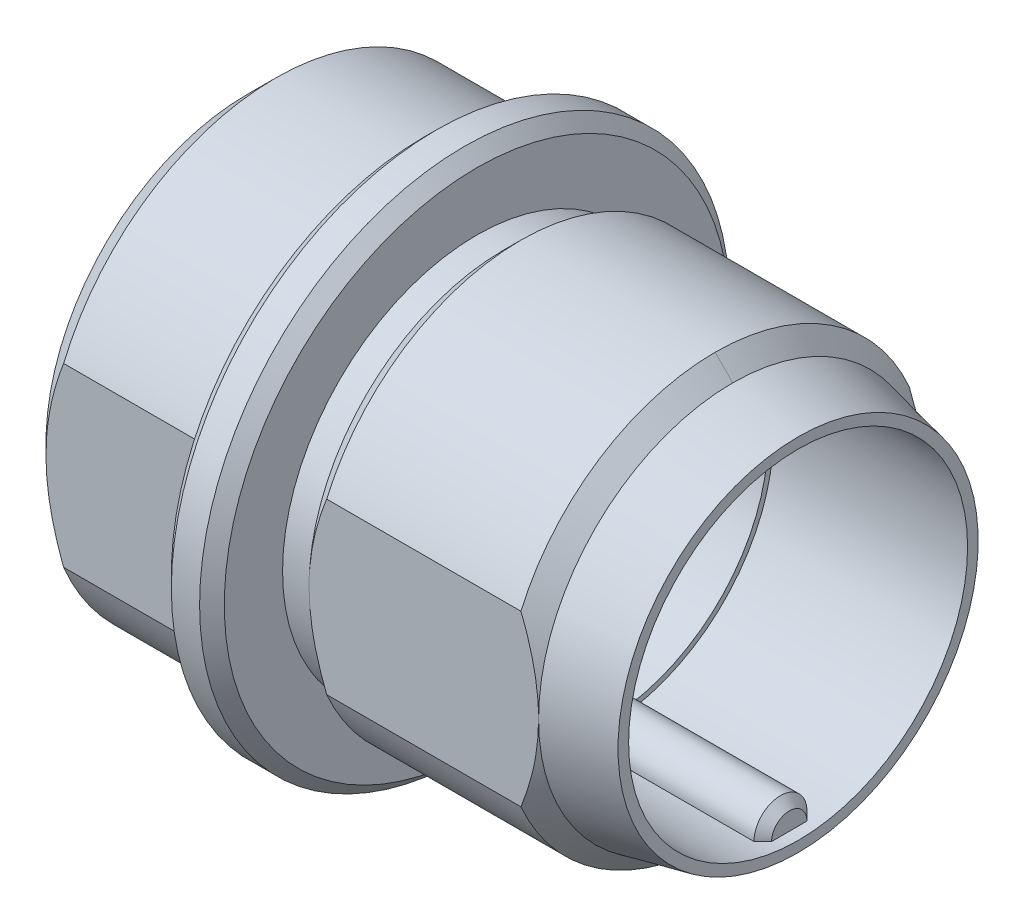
ISO-10303-21;
HEADER;
FILE_DESCRIPTION(('STEP AP214'),'2;1');
FILE_NAME('part.step','',(''),(''),'','','');
FILE_SCHEMA(('AUTOMOTIVE_DESIGN { 1 0 10303 214 1 1 1 1 }'));
ENDSEC;
DATA;
#1=APPLICATION_CONTEXT('core data for automotive mechanical design processes');
#2=APPLICATION_PROTOCOL_DEFINITION('international standard','automotive_design',2000,#1);
#3=PRODUCT_CONTEXT('',#1,'mechanical');
#4=PRODUCT('Part','Part','',(#3));
#5=PRODUCT_RELATED_PRODUCT_CATEGORY('part','',(#4));
#6=PRODUCT_DEFINITION_FORMATION('','',#4);
#7=PRODUCT_DEFINITION_CONTEXT('part definition',#1,'design');
#8=PRODUCT_DEFINITION('design','',#6,#7);
#9=PRODUCT_DEFINITION_SHAPE('','',#8);
#10=(LENGTH_UNIT() NAMED_UNIT(*) SI_UNIT(.MILLI.,.METRE.));
#11=(NAMED_UNIT(*) PLANE_ANGLE_UNIT() SI_UNIT($,.RADIAN.));
#12=(NAMED_UNIT(*) SI_UNIT($,.STERADIAN.) SOLID_ANGLE_UNIT());
#13=UNCERTAINTY_MEASURE_WITH_UNIT(LENGTH_MEASURE(1.E-05),#10,'distance_accuracy_value','');
#14=(GEOMETRIC_REPRESENTATION_CONTEXT(3) GLOBAL_UNCERTAINTY_ASSIGNED_CONTEXT((#13)) GLOBAL_UNIT_ASSIGNED_CONTEXT((#10,
#11,#12)) REPRESENTATION_CONTEXT('',''));
#15=CARTESIAN_POINT('',(0.,0.,0.));
#16=DIRECTION('',(0.,0.,1.));
#17=DIRECTION('',(1.,0.,0.));
#18=AXIS2_PLACEMENT_3D('',#15,#16,#17);
#19=CARTESIAN_POINT('',(-1.5,0.,0.));
#20=DIRECTION('',(1.,0.,0.));
#21=DIRECTION('',(0.,0.,-1.));
#22=AXIS2_PLACEMENT_3D('',#19,#20,#21);
#23=CYLINDRICAL_SURFACE('',#22,7.5);
#24=DIRECTION('',(1.,0.,0.));
#25=VECTOR('',#24,1.);
#26=CARTESIAN_POINT('',(-1.5,7.5,0.));
#27=LINE('',#26,#25);
#28=CARTESIAN_POINT('',(-0.35,7.5,0.));
#29=VERTEX_POINT('',#28);
#30=CARTESIAN_POINT('',(-1.15,7.5,0.));
#31=VERTEX_POINT('',#30);
#32=EDGE_CURVE('E20',#29,#31,#27,.F.);
#33=ORIENTED_EDGE('',*,*,#32,.F.);
#34=CARTESIAN_POINT('',(-0.35,0.,0.));
#35=DIRECTION('',(-1.,0.,0.));
#36=DIRECTION('',(0.,1.,0.));
#37=AXIS2_PLACEMENT_3D('',#34,#35,#36);
#38=CIRCLE('',#37,7.5);
#39=EDGE_CURVE('E79',#29,#29,#38,.F.);
#40=ORIENTED_EDGE('',*,*,#39,.F.);
#41=ORIENTED_EDGE('',*,*,#32,.T.);
#42=CARTESIAN_POINT('',(-1.15,0.,0.));
#43=DIRECTION('',(1.,0.,0.));
#44=DIRECTION('',(0.,1.,0.));
#45=AXIS2_PLACEMENT_3D('',#42,#43,#44);
#46=CIRCLE('',#45,7.5);
#47=EDGE_CURVE('E86',#31,#31,#46,.F.);
#48=ORIENTED_EDGE('',*,*,#47,.F.);
#49=EDGE_LOOP('',(#33,#40,#41,#48));
#50=FACE_BOUND('',#49,.T.);
#51=ADVANCED_FACE('F17',(#50),#23,.T.);
#52=CARTESIAN_POINT('',(-1.15,0.,0.));
#53=DIRECTION('',(1.,0.,0.));
#54=DIRECTION('',(0.,0.,-1.));
#55=AXIS2_PLACEMENT_3D('',#52,#53,#54);
#56=CONICAL_SURFACE('',#55,7.5,0.785398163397);
#57=CARTESIAN_POINT('',(-1.49999999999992,0.,0.));
#58=DIRECTION('',(1.,0.,0.));
#59=DIRECTION('',(0.,0.,-1.));
#60=AXIS2_PLACEMENT_3D('',#57,#58,#59);
#61=CIRCLE('',#60,7.15000000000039);
#62=CARTESIAN_POINT('',(-1.49999999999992,-3.88876587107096,5.99999999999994));
#63=VERTEX_POINT('',#62);
#64=CARTESIAN_POINT('',(-1.49999999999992,-3.88876587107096,-5.99999999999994));
#65=VERTEX_POINT('',#64);
#66=EDGE_CURVE('E100',#63,#65,#61,.T.);
#67=ORIENTED_EDGE('',*,*,#66,.T.);
#68=CARTESIAN_POINT('',(-1.49999999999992,0.,0.));
#69=DIRECTION('',(1.,0.,0.));
#70=DIRECTION('',(0.,0.,-1.));
#71=AXIS2_PLACEMENT_3D('',#68,#69,#70);
#72=CIRCLE('',#71,7.15000000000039);
#73=CARTESIAN_POINT('',(-1.5000000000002,3.88876587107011,-6.00000000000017));
#74=VERTEX_POINT('',#73);
#75=EDGE_CURVE('E943',#65,#74,#72,.T.);
#76=ORIENTED_EDGE('',*,*,#75,.T.);
#77=CARTESIAN_POINT('',(-1.5000000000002,0.,0.));
#78=DIRECTION('',(1.,0.,0.));
#79=DIRECTION('',(0.,0.,-1.));
#80=AXIS2_PLACEMENT_3D('',#77,#78,#79);
#81=CIRCLE('',#80,7.15000000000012);
#82=CARTESIAN_POINT('',(-1.50000000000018,7.15000000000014,0.));
#83=VERTEX_POINT('',#82);
#84=EDGE_CURVE('E941',#74,#83,#81,.T.);
#85=ORIENTED_EDGE('',*,*,#84,.T.);
#86=DIRECTION('',(-0.707106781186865,-0.70710678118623,0.));
#87=VECTOR('',#86,1.);
#88=CARTESIAN_POINT('',(-1.15,7.5,0.));
#89=LINE('',#88,#87);
#90=EDGE_CURVE('E91',#83,#31,#89,.F.);
#91=ORIENTED_EDGE('',*,*,#90,.T.);
#92=ORIENTED_EDGE('',*,*,#47,.T.);
#93=ORIENTED_EDGE('',*,*,#90,.F.);
#94=CARTESIAN_POINT('',(-1.50000000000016,0.,0.));
#95=DIRECTION('',(1.,0.,0.));
#96=DIRECTION('',(0.,0.,-1.));
#97=AXIS2_PLACEMENT_3D('',#94,#95,#96);
#98=CIRCLE('',#97,7.15000000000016);
#99=CARTESIAN_POINT('',(-1.5000000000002,3.88876587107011,6.00000000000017));
#100=VERTEX_POINT('',#99);
#101=EDGE_CURVE('E939',#83,#100,#98,.T.);
#102=ORIENTED_EDGE('',*,*,#101,.T.);
#103=CARTESIAN_POINT('',(-1.5000000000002,0.,0.));
#104=DIRECTION('',(1.,0.,0.));
#105=DIRECTION('',(0.,0.,-1.));
#106=AXIS2_PLACEMENT_3D('',#103,#104,#105);
#107=CIRCLE('',#106,7.15000000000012);
#108=EDGE_CURVE('E936',#100,#63,#107,.T.);
#109=ORIENTED_EDGE('',*,*,#108,.T.);
#110=EDGE_LOOP('',(#67,#76,#85,#91,#92,#93,#102,#109));
#111=FACE_BOUND('',#110,.T.);
#112=ADVANCED_FACE('F89',(#111),#56,.T.);
#113=CARTESIAN_POINT('',(-0.35,0.,0.));
#114=DIRECTION('',(-1.,0.,0.));
#115=DIRECTION('',(0.,0.,1.));
#116=AXIS2_PLACEMENT_3D('',#113,#114,#115);
#117=CONICAL_SURFACE('',#116,7.5,0.785398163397);
#118=DIRECTION('',(0.707106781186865,-0.70710678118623,0.));
#119=VECTOR('',#118,1.);
#120=CARTESIAN_POINT('',(-0.35,7.5,0.));
#121=LINE('',#120,#119);
#122=CARTESIAN_POINT('',(1.56992474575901E-13,7.15000000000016,0.));
#123=VERTEX_POINT('',#122);
#124=EDGE_CURVE('E94',#123,#29,#121,.F.);
#125=ORIENTED_EDGE('',*,*,#124,.F.);
#126=CARTESIAN_POINT('',(1.56992474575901E-13,0.,0.));
#127=DIRECTION('',(-1.,0.,0.));
#128=DIRECTION('',(0.,0.,1.));
#129=AXIS2_PLACEMENT_3D('',#126,#127,#128);
#130=CIRCLE('',#129,7.15000000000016);
#131=EDGE_CURVE('E33',#123,#123,#130,.F.);
#132=ORIENTED_EDGE('',*,*,#131,.F.);
#133=ORIENTED_EDGE('',*,*,#124,.T.);
#134=ORIENTED_EDGE('',*,*,#39,.T.);
#135=EDGE_LOOP('',(#125,#132,#133,#134));
#136=FACE_BOUND('',#135,.T.);
#137=ADVANCED_FACE('F532',(#136),#117,.T.);
#138=CARTESIAN_POINT('',(-1.50000000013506,0.,0.));
#139=DIRECTION('',(1.,0.,0.));
#140=DIRECTION('',(0.,0.,-1.));
#141=AXIS2_PLACEMENT_3D('',#138,#139,#140);
#142=CONICAL_SURFACE('',#141,6.84999999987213,0.785398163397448);
#143=CARTESIAN_POINT('',(-1.50000000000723,-3.30492057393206,-6.));
#144=CARTESIAN_POINT('',(-1.5317975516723,-3.23901296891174,-6.));
#145=CARTESIAN_POINT('',(-1.56300537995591,-3.17281878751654,-6.));
#146=CARTESIAN_POINT('',(-1.6241297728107,-3.03987116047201,-6.));
#147=CARTESIAN_POINT('',(-1.65404687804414,-2.97311796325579,-6.));
#148=CARTESIAN_POINT('',(-1.71250613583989,-2.83900802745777,-6.));
#149=CARTESIAN_POINT('',(-1.74104823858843,-2.77165126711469,-6.));
#150=CARTESIAN_POINT('',(-1.79665969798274,-2.63629958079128,-6.));
#151=CARTESIAN_POINT('',(-1.82372842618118,-2.56830439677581,-6.));
#152=CARTESIAN_POINT('',(-1.85000000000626,-2.50000000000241,-6.));
#153=B_SPLINE_CURVE_WITH_KNOTS('',3,(#143,#144,#145,#146,#147,#148,#149,#150,#151,#152),
.UNSPECIFIED.,.F.,.F.,(4,2,2,2,4),(0.,0.219531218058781,0.438969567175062,0.658415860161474,
0.877955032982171),.UNSPECIFIED.);
#154=CARTESIAN_POINT('',(-1.50000000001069,-3.30492057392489,-6.));
#155=VERTEX_POINT('',#154);
#156=CARTESIAN_POINT('',(-1.85000000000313,-2.50000000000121,-6.));
#157=VERTEX_POINT('',#156);
#158=EDGE_CURVE('E473',#155,#157,#153,.T.);
#159=ORIENTED_EDGE('',*,*,#158,.F.);
#160=CARTESIAN_POINT('',(-1.50000000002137,0.,0.));
#161=DIRECTION('',(1.,0.,0.));
#162=DIRECTION('',(0.,0.,-1.));
#163=AXIS2_PLACEMENT_3D('',#160,#161,#162);
#164=CIRCLE('',#163,6.84999999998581);
#165=CARTESIAN_POINT('',(-1.5000000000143,-3.3049205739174,6.));
#166=VERTEX_POINT('',#165);
#167=EDGE_CURVE('E933',#155,#166,#164,.F.);
#168=ORIENTED_EDGE('',*,*,#167,.T.);
#169=CARTESIAN_POINT('',(-1.85000000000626,-2.50000000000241,6.));
#170=CARTESIAN_POINT('',(-1.82372842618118,-2.56830439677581,6.));
#171=CARTESIAN_POINT('',(-1.79665969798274,-2.63629958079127,6.));
#172=CARTESIAN_POINT('',(-1.74104823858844,-2.77165126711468,6.));
#173=CARTESIAN_POINT('',(-1.71250613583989,-2.83900802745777,6.));
#174=CARTESIAN_POINT('',(-1.65404687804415,-2.97311796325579,6.));
#175=CARTESIAN_POINT('',(-1.6241297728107,-3.03987116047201,6.));
#176=CARTESIAN_POINT('',(-1.56300537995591,-3.17281878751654,6.));
#177=CARTESIAN_POINT('',(-1.5317975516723,-3.23901296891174,6.));
#178=CARTESIAN_POINT('',(-1.50000000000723,-3.30492057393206,6.));
#179=B_SPLINE_CURVE_WITH_KNOTS('',3,(#169,#170,#171,#172,#173,#174,#175,#176,#177,#178),
.UNSPECIFIED.,.F.,.F.,(4,2,2,2,4),(0.,0.219539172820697,0.43898546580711,0.65842381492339,
0.877955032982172),.UNSPECIFIED.);
#180=CARTESIAN_POINT('',(-1.85000000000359,-2.5,6.));
#181=VERTEX_POINT('',#180);
#182=EDGE_CURVE('E451',#181,#166,#179,.T.);
#183=ORIENTED_EDGE('',*,*,#182,.F.);
#184=CARTESIAN_POINT('',(-1.85,0.,0.));
#185=DIRECTION('',(1.,0.,0.));
#186=DIRECTION('',(0.,0.,-1.));
#187=AXIS2_PLACEMENT_3D('',#184,#185,#186);
#188=CIRCLE('',#187,6.5);
#189=EDGE_CURVE('E469',#157,#181,#188,.F.);
#190=ORIENTED_EDGE('',*,*,#189,.F.);
#191=EDGE_LOOP('',(#159,#168,#183,#190));
#192=FACE_BOUND('',#191,.T.);
#193=ADVANCED_FACE('F526',(#192),#142,.T.);
#194=CARTESIAN_POINT('',(-1.5,0.,0.));
#195=DIRECTION('',(1.,0.,0.));
#196=DIRECTION('',(0.,0.,-1.));
#197=AXIS2_PLACEMENT_3D('',#194,#195,#196);
#198=PLANE('',#197);
#199=ORIENTED_EDGE('',*,*,#167,.F.);
#200=DIRECTION('',(0.,1.,0.));
#201=VECTOR('',#200,1.);
#202=CARTESIAN_POINT('',(-1.5,5.,-6.));
#203=LINE('',#202,#201);
#204=CARTESIAN_POINT('',(-1.5000000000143,3.3049205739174,-6.));
#205=VERTEX_POINT('',#204);
#206=EDGE_CURVE('E470',#205,#155,#203,.F.);
#207=ORIENTED_EDGE('',*,*,#206,.F.);
#208=CARTESIAN_POINT('',(-1.50000000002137,0.,0.));
#209=DIRECTION('',(1.,0.,0.));
#210=DIRECTION('',(0.,0.,-1.));
#211=AXIS2_PLACEMENT_3D('',#208,#209,#210);
#212=CIRCLE('',#211,6.84999999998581);
#213=CARTESIAN_POINT('',(-1.50000000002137,6.84999999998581,0.));
#214=VERTEX_POINT('',#213);
#215=EDGE_CURVE('E494',#214,#205,#212,.F.);
#216=ORIENTED_EDGE('',*,*,#215,.F.);
#217=CARTESIAN_POINT('',(-1.50000000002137,0.,0.));
#218=DIRECTION('',(1.,0.,0.));
#219=DIRECTION('',(0.,0.,-1.));
#220=AXIS2_PLACEMENT_3D('',#217,#218,#219);
#221=CIRCLE('',#220,6.84999999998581);
#222=CARTESIAN_POINT('',(-1.50000000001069,3.30492057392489,6.));
#223=VERTEX_POINT('',#222);
#224=EDGE_CURVE('E493',#223,#214,#221,.F.);
#225=ORIENTED_EDGE('',*,*,#224,.F.);
#226=DIRECTION('',(0.,1.,0.));
#227=VECTOR('',#226,1.);
#228=CARTESIAN_POINT('',(-1.5,-5.,6.));
#229=LINE('',#228,#227);
#230=EDGE_CURVE('E449',#166,#223,#229,.T.);
#231=ORIENTED_EDGE('',*,*,#230,.F.);
#232=EDGE_LOOP('',(#199,#207,#216,#225,#231));
#233=FACE_BOUND('',#232,.T.);
#234=ORIENTED_EDGE('',*,*,#101,.F.);
#235=ORIENTED_EDGE('',*,*,#84,.F.);
#236=ORIENTED_EDGE('',*,*,#75,.F.);
#237=ORIENTED_EDGE('',*,*,#66,.F.);
#238=ORIENTED_EDGE('',*,*,#108,.F.);
#239=EDGE_LOOP('',(#234,#235,#236,#237,#238));
#240=FACE_BOUND('',#239,.T.);
#241=ADVANCED_FACE('F531',(#233,#240),#198,.F.);
#242=CARTESIAN_POINT('',(-1.50000000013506,0.,0.));
#243=DIRECTION('',(1.,0.,0.));
#244=DIRECTION('',(0.,0.,-1.));
#245=AXIS2_PLACEMENT_3D('',#242,#243,#244);
#246=CONICAL_SURFACE('',#245,6.84999999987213,0.785398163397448);
#247=ORIENTED_EDGE('',*,*,#215,.T.);
#248=CARTESIAN_POINT('',(-1.85000000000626,2.50000000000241,-6.));
#249=CARTESIAN_POINT('',(-1.82372842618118,2.56830439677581,-6.));
#250=CARTESIAN_POINT('',(-1.79665969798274,2.63629958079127,-6.));
#251=CARTESIAN_POINT('',(-1.74104823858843,2.77165126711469,-6.));
#252=CARTESIAN_POINT('',(-1.71250613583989,2.83900802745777,-6.));
#253=CARTESIAN_POINT('',(-1.65404687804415,2.97311796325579,-6.));
#254=CARTESIAN_POINT('',(-1.6241297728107,3.03987116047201,-6.));
#255=CARTESIAN_POINT('',(-1.56300537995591,3.17281878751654,-6.));
#256=CARTESIAN_POINT('',(-1.5317975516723,3.23901296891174,-6.));
#257=CARTESIAN_POINT('',(-1.50000000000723,3.30492057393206,-6.));
#258=B_SPLINE_CURVE_WITH_KNOTS('',3,(#248,#249,#250,#251,#252,#253,#254,#255,#256,#257),
.UNSPECIFIED.,.F.,.F.,(4,2,2,2,4),(0.,0.219539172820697,0.43898546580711,0.658423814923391,
0.877955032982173),.UNSPECIFIED.);
#259=CARTESIAN_POINT('',(-1.85000000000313,2.5000000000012,-6.));
#260=VERTEX_POINT('',#259);
#261=EDGE_CURVE('E474',#260,#205,#258,.T.);
#262=ORIENTED_EDGE('',*,*,#261,.F.);
#263=CARTESIAN_POINT('',(-1.85,0.,0.));
#264=DIRECTION('',(1.,0.,0.));
#265=DIRECTION('',(0.,0.,-1.));
#266=AXIS2_PLACEMENT_3D('',#263,#264,#265);
#267=CIRCLE('',#266,6.5);
#268=CARTESIAN_POINT('',(-1.85000000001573,6.49999999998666,0.));
#269=VERTEX_POINT('',#268);
#270=EDGE_CURVE('E447',#269,#260,#267,.F.);
#271=ORIENTED_EDGE('',*,*,#270,.F.);
#272=DIRECTION('',(-0.707106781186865,-0.707106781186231,0.));
#273=VECTOR('',#272,1.);
#274=CARTESIAN_POINT('',(498991.650000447,499000.,0.));
#275=LINE('',#274,#273);
#276=EDGE_CURVE('E490',#214,#269,#275,.T.);
#277=ORIENTED_EDGE('',*,*,#276,.F.);
#278=EDGE_LOOP('',(#247,#262,#271,#277));
#279=FACE_BOUND('',#278,.T.);
#280=ADVANCED_FACE('F564',(#279),#246,.T.);
#281=CARTESIAN_POINT('',(-1.50000000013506,0.,0.));
#282=DIRECTION('',(1.,0.,0.));
#283=DIRECTION('',(0.,0.,-1.));
#284=AXIS2_PLACEMENT_3D('',#281,#282,#283);
#285=CONICAL_SURFACE('',#284,6.84999999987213,0.785398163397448);
#286=CARTESIAN_POINT('',(-1.50000000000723,3.30492057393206,6.));
#287=CARTESIAN_POINT('',(-1.5317975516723,3.23901296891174,6.));
#288=CARTESIAN_POINT('',(-1.56300537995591,3.17281878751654,6.));
#289=CARTESIAN_POINT('',(-1.6241297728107,3.03987116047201,6.));
#290=CARTESIAN_POINT('',(-1.65404687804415,2.97311796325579,6.));
#291=CARTESIAN_POINT('',(-1.71250613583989,2.83900802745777,6.));
#292=CARTESIAN_POINT('',(-1.74104823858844,2.77165126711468,6.));
#293=CARTESIAN_POINT('',(-1.79665969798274,2.63629958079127,6.));
#294=CARTESIAN_POINT('',(-1.82372842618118,2.56830439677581,6.));
#295=CARTESIAN_POINT('',(-1.85000000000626,2.50000000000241,6.));
#296=B_SPLINE_CURVE_WITH_KNOTS('',3,(#286,#287,#288,#289,#290,#291,#292,#293,#294,#295),
.UNSPECIFIED.,.F.,.F.,(4,2,2,2,4),(0.,0.219531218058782,0.438969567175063,0.658415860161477,
0.877955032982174),.UNSPECIFIED.);
#297=CARTESIAN_POINT('',(-1.85000000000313,2.5000000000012,6.));
#298=VERTEX_POINT('',#297);
#299=EDGE_CURVE('E448',#223,#298,#296,.T.);
#300=ORIENTED_EDGE('',*,*,#299,.F.);
#301=ORIENTED_EDGE('',*,*,#224,.T.);
#302=ORIENTED_EDGE('',*,*,#276,.T.);
#303=CARTESIAN_POINT('',(-1.85,0.,0.));
#304=DIRECTION('',(1.,0.,0.));
#305=DIRECTION('',(0.,0.,-1.));
#306=AXIS2_PLACEMENT_3D('',#303,#304,#305);
#307=CIRCLE('',#306,6.5);
#308=EDGE_CURVE('E460',#298,#269,#307,.F.);
#309=ORIENTED_EDGE('',*,*,#308,.F.);
#310=EDGE_LOOP('',(#300,#301,#302,#309));
#311=FACE_BOUND('',#310,.T.);
#312=ADVANCED_FACE('F571',(#311),#285,.T.);
#313=CARTESIAN_POINT('',(0.,0.,0.));
#314=DIRECTION('',(1.,0.,0.));
#315=DIRECTION('',(0.,0.,-1.));
#316=AXIS2_PLACEMENT_3D('',#313,#314,#315);
#317=PLANE('',#316);
#318=CARTESIAN_POINT('',(0.,0.,0.));
#319=DIRECTION('',(1.,0.,0.));
#320=DIRECTION('',(0.,0.,-1.));
#321=AXIS2_PLACEMENT_3D('',#318,#319,#320);
#322=CIRCLE('',#321,5.5);
#323=CARTESIAN_POINT('',(0.,5.5,0.));
#324=VERTEX_POINT('',#323);
#325=EDGE_CURVE('E441',#324,#324,#322,.T.);
#326=ORIENTED_EDGE('',*,*,#325,.F.);
#327=EDGE_LOOP('',(#326));
#328=FACE_BOUND('',#327,.T.);
#329=ORIENTED_EDGE('',*,*,#131,.T.);
#330=EDGE_LOOP('',(#329));
#331=FACE_BOUND('',#330,.T.);
#332=ADVANCED_FACE('F578',(#328,#331),#317,.T.);
#333=CARTESIAN_POINT('',(-6.5,5.,-6.));
#334=DIRECTION('',(0.,0.,-1.));
#335=DIRECTION('',(-1.,0.,0.));
#336=AXIS2_PLACEMENT_3D('',#333,#334,#335);
#337=PLANE('',#336);
#338=CARTESIAN_POINT('',(-5.70000000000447,2.50000000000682,-6.));
#339=CARTESIAN_POINT('',(-5.77551340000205,2.30377822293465,-6.));
#340=CARTESIAN_POINT('',(-5.84444573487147,2.10477809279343,-6.));
#341=CARTESIAN_POINT('',(-5.96639505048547,1.70139178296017,-6.));
#342=CARTESIAN_POINT('',(-6.01936732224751,1.49699218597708,-6.));
#343=CARTESIAN_POINT('',(-6.10460180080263,1.09163496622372,-6.));
#344=CARTESIAN_POINT('',(-6.13755132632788,0.89082537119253,-6.));
#345=CARTESIAN_POINT('',(-6.18358635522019,0.487185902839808,-6.));
#346=CARTESIAN_POINT('',(-6.19669889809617,0.284359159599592,-6.));
#347=CARTESIAN_POINT('',(-6.20237381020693,-0.134626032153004,-6.));
#348=CARTESIAN_POINT('',(-6.19356374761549,-0.350804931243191,-6.));
#349=CARTESIAN_POINT('',(-6.15315191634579,-0.781300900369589,-6.));
#350=CARTESIAN_POINT('',(-6.12151431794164,-0.995614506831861,-6.));
#351=CARTESIAN_POINT('',(-6.03604608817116,-1.42872071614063,-6.));
#352=CARTESIAN_POINT('',(-5.98137067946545,-1.64734459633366,-6.));
#353=CARTESIAN_POINT('',(-5.88548583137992,-1.97070594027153,-6.));
#354=CARTESIAN_POINT('',(-5.85126605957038,-2.07759376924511,-6.));
#355=CARTESIAN_POINT('',(-5.77865401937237,-2.28989306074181,-6.));
#356=CARTESIAN_POINT('',(-5.74026359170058,-2.3953051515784,-6.));
#357=CARTESIAN_POINT('',(-5.70000000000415,-2.50000000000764,-6.));
#358=B_SPLINE_CURVE_WITH_KNOTS('',3,(#338,#339,#340,#341,#342,#343,#344,#345,#346,#347,#348,
#349,#350,#351,#352,#353,#354,#355,#356,#357),.UNSPECIFIED.,.F.,.F.,(4,2,2,2,2,2,2,2,2,4),(0.,
0.630980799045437,1.26371307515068,1.87327645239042,2.48200819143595,3.12979492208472,
3.77860062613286,4.45361201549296,4.79023798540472,5.12671598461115),.UNSPECIFIED.);
#359=CARTESIAN_POINT('',(-5.69999999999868,2.50000000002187,-6.));
#360=VERTEX_POINT('',#359);
#361=CARTESIAN_POINT('',(-5.69999999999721,-2.50000000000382,-6.));
#362=VERTEX_POINT('',#361);
#363=EDGE_CURVE('E456',#360,#362,#358,.T.);
#364=ORIENTED_EDGE('',*,*,#363,.F.);
#365=DIRECTION('',(1.,0.,0.));
#366=VECTOR('',#365,1.);
#367=CARTESIAN_POINT('',(-6.5,2.5,-6.));
#368=LINE('',#367,#366);
#369=EDGE_CURVE('E461',#260,#360,#368,.F.);
#370=ORIENTED_EDGE('',*,*,#369,.F.);
#371=ORIENTED_EDGE('',*,*,#261,.T.);
#372=ORIENTED_EDGE('',*,*,#206,.T.);
#373=ORIENTED_EDGE('',*,*,#158,.T.);
#374=DIRECTION('',(1.,0.,0.));
#375=VECTOR('',#374,1.);
#376=CARTESIAN_POINT('',(-6.5,-2.5,-6.));
#377=LINE('',#376,#375);
#378=EDGE_CURVE('E466',#362,#157,#377,.T.);
#379=ORIENTED_EDGE('',*,*,#378,.F.);
#380=EDGE_LOOP('',(#364,#370,#371,#372,#373,#379));
#381=FACE_BOUND('',#380,.T.);
#382=ADVANCED_FACE('F522',(#381),#337,.T.);
#383=CARTESIAN_POINT('',(-6.5,0.,0.));
#384=DIRECTION('',(1.,0.,0.));
#385=DIRECTION('',(0.,0.,-1.));
#386=AXIS2_PLACEMENT_3D('',#383,#384,#385);
#387=CYLINDRICAL_SURFACE('',#386,6.5);
#388=CARTESIAN_POINT('',(-5.69999999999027,0.,0.));
#389=DIRECTION('',(1.,0.,0.));
#390=DIRECTION('',(0.,1.,0.));
#391=AXIS2_PLACEMENT_3D('',#388,#389,#390);
#392=CIRCLE('',#391,6.50000000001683);
#393=CARTESIAN_POINT('',(-5.69999999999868,-2.50000000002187,6.));
#394=VERTEX_POINT('',#393);
#395=EDGE_CURVE('E452',#362,#394,#392,.F.);
#396=ORIENTED_EDGE('',*,*,#395,.F.);
#397=ORIENTED_EDGE('',*,*,#378,.T.);
#398=ORIENTED_EDGE('',*,*,#189,.T.);
#399=DIRECTION('',(1.,0.,0.));
#400=VECTOR('',#399,1.);
#401=CARTESIAN_POINT('',(-6.5,-2.5,6.));
#402=LINE('',#401,#400);
#403=EDGE_CURVE('E444',#394,#181,#402,.T.);
#404=ORIENTED_EDGE('',*,*,#403,.F.);
#405=EDGE_LOOP('',(#396,#397,#398,#404));
#406=FACE_BOUND('',#405,.T.);
#407=ADVANCED_FACE('F592',(#406),#387,.T.);
#408=CARTESIAN_POINT('',(-6.5,-5.,6.));
#409=DIRECTION('',(0.,0.,1.));
#410=DIRECTION('',(1.,0.,0.));
#411=AXIS2_PLACEMENT_3D('',#408,#409,#410);
#412=PLANE('',#411);
#413=CARTESIAN_POINT('',(-5.70000000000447,-2.50000000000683,6.));
#414=CARTESIAN_POINT('',(-5.77551340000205,-2.30377822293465,6.));
#415=CARTESIAN_POINT('',(-5.84444573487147,-2.10477809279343,6.));
#416=CARTESIAN_POINT('',(-5.96639505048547,-1.70139178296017,6.));
#417=CARTESIAN_POINT('',(-6.01936732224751,-1.49699218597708,6.));
#418=CARTESIAN_POINT('',(-6.10460180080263,-1.09163496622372,6.));
#419=CARTESIAN_POINT('',(-6.13755132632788,-0.890825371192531,6.));
#420=CARTESIAN_POINT('',(-6.18358635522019,-0.487185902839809,6.));
#421=CARTESIAN_POINT('',(-6.19669889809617,-0.284359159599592,6.));
#422=CARTESIAN_POINT('',(-6.20237381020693,0.134626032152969,6.));
#423=CARTESIAN_POINT('',(-6.1935637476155,0.350804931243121,6.));
#424=CARTESIAN_POINT('',(-6.15315191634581,0.78130090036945,6.));
#425=CARTESIAN_POINT('',(-6.12151431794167,0.995614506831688,6.));
#426=CARTESIAN_POINT('',(-6.03604608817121,1.42872071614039,6.));
#427=CARTESIAN_POINT('',(-5.98137067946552,1.64734459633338,6.));
#428=CARTESIAN_POINT('',(-5.88548583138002,1.97070594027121,6.));
#429=CARTESIAN_POINT('',(-5.85126605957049,2.07759376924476,6.));
#430=CARTESIAN_POINT('',(-5.77865401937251,2.28989306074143,6.));
#431=CARTESIAN_POINT('',(-5.74026359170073,2.395305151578,6.));
#432=CARTESIAN_POINT('',(-5.70000000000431,2.50000000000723,6.));
#433=B_SPLINE_CURVE_WITH_KNOTS('',3,(#413,#414,#415,#416,#417,#418,#419,#420,#421,#422,#423,
#424,#425,#426,#427,#428,#429,#430,#431,#432),.UNSPECIFIED.,.F.,.F.,(4,2,2,2,2,2,2,2,2,4),(0.,
0.630980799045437,1.26371307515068,1.87327645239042,2.48200819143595,3.12979492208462,
3.77860062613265,4.45361201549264,4.79023798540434,5.12671598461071),.UNSPECIFIED.);
#434=CARTESIAN_POINT('',(-5.69999999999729,2.50000000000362,6.));
#435=VERTEX_POINT('',#434);
#436=EDGE_CURVE('E455',#394,#435,#433,.T.);
#437=ORIENTED_EDGE('',*,*,#436,.F.);
#438=ORIENTED_EDGE('',*,*,#403,.T.);
#439=ORIENTED_EDGE('',*,*,#182,.T.);
#440=ORIENTED_EDGE('',*,*,#230,.T.);
#441=ORIENTED_EDGE('',*,*,#299,.T.);
#442=DIRECTION('',(1.,0.,0.));
#443=VECTOR('',#442,1.);
#444=CARTESIAN_POINT('',(-6.5,2.5,6.));
#445=LINE('',#444,#443);
#446=EDGE_CURVE('E457',#435,#298,#445,.T.);
#447=ORIENTED_EDGE('',*,*,#446,.F.);
#448=EDGE_LOOP('',(#437,#438,#439,#440,#441,#447));
#449=FACE_BOUND('',#448,.T.);
#450=ADVANCED_FACE('F598',(#449),#412,.T.);
#451=CARTESIAN_POINT('',(-6.5,0.,0.));
#452=DIRECTION('',(1.,0.,0.));
#453=DIRECTION('',(0.,0.,-1.));
#454=AXIS2_PLACEMENT_3D('',#451,#452,#453);
#455=CYLINDRICAL_SURFACE('',#454,6.5);
#456=ORIENTED_EDGE('',*,*,#446,.T.);
#457=ORIENTED_EDGE('',*,*,#308,.T.);
#458=ORIENTED_EDGE('',*,*,#270,.T.);
#459=ORIENTED_EDGE('',*,*,#369,.T.);
#460=CARTESIAN_POINT('',(-5.69999999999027,0.,0.));
#461=DIRECTION('',(1.,0.,0.));
#462=DIRECTION('',(0.,1.,0.));
#463=AXIS2_PLACEMENT_3D('',#460,#461,#462);
#464=CIRCLE('',#463,6.50000000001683);
#465=CARTESIAN_POINT('',(-5.69999999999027,6.50000000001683,0.));
#466=VERTEX_POINT('',#465);
#467=EDGE_CURVE('E440',#466,#360,#464,.F.);
#468=ORIENTED_EDGE('',*,*,#467,.F.);
#469=CARTESIAN_POINT('',(-5.69999999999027,0.,0.));
#470=DIRECTION('',(1.,0.,0.));
#471=DIRECTION('',(0.,1.,0.));
#472=AXIS2_PLACEMENT_3D('',#469,#470,#471);
#473=CIRCLE('',#472,6.50000000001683);
#474=EDGE_CURVE('E436',#435,#466,#473,.F.);
#475=ORIENTED_EDGE('',*,*,#474,.F.);
#476=EDGE_LOOP('',(#456,#457,#458,#459,#468,#475));
#477=FACE_BOUND('',#476,.T.);
#478=ADVANCED_FACE('F604',(#477),#455,.T.);
#479=CARTESIAN_POINT('',(0.,0.,0.));
#480=DIRECTION('',(1.,0.,0.));
#481=DIRECTION('',(0.,0.,-1.));
#482=AXIS2_PLACEMENT_3D('',#479,#480,#481);
#483=CYLINDRICAL_SURFACE('',#482,5.5);
#484=CARTESIAN_POINT('',(0.750000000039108,0.,0.));
#485=DIRECTION('',(1.,0.,0.));
#486=DIRECTION('',(0.,1.,0.));
#487=AXIS2_PLACEMENT_3D('',#484,#485,#486);
#488=CIRCLE('',#487,5.50000000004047);
#489=CARTESIAN_POINT('',(0.750000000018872,0.,5.50000000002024));
#490=VERTEX_POINT('',#489);
#491=CARTESIAN_POINT('',(0.750000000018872,0.,-5.50000000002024));
#492=VERTEX_POINT('',#491);
#493=EDGE_CURVE('E418',#490,#492,#488,.T.);
#494=ORIENTED_EDGE('',*,*,#493,.F.);
#495=CARTESIAN_POINT('',(0.750000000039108,0.,0.));
#496=DIRECTION('',(1.,0.,0.));
#497=DIRECTION('',(0.,1.,0.));
#498=AXIS2_PLACEMENT_3D('',#495,#496,#497);
#499=CIRCLE('',#498,5.50000000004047);
#500=CARTESIAN_POINT('',(0.749999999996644,5.50000000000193,0.));
#501=VERTEX_POINT('',#500);
#502=EDGE_CURVE('E425',#501,#490,#499,.T.);
#503=ORIENTED_EDGE('',*,*,#502,.F.);
#504=DIRECTION('',(1.,0.,0.));
#505=VECTOR('',#504,1.);
#506=CARTESIAN_POINT('',(0.,5.5,0.));
#507=LINE('',#506,#505);
#508=EDGE_CURVE('E483',#501,#324,#507,.F.);
#509=ORIENTED_EDGE('',*,*,#508,.T.);
#510=ORIENTED_EDGE('',*,*,#325,.T.);
#511=ORIENTED_EDGE('',*,*,#508,.F.);
#512=CARTESIAN_POINT('',(0.750000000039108,0.,0.));
#513=DIRECTION('',(1.,0.,0.));
#514=DIRECTION('',(0.,1.,0.));
#515=AXIS2_PLACEMENT_3D('',#512,#513,#514);
#516=CIRCLE('',#515,5.50000000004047);
#517=EDGE_CURVE('E422',#492,#501,#516,.T.);
#518=ORIENTED_EDGE('',*,*,#517,.F.);
#519=EDGE_LOOP('',(#494,#503,#509,#510,#511,#518));
#520=FACE_BOUND('',#519,.T.);
#521=ADVANCED_FACE('F611',(#520),#483,.T.);
#522=CARTESIAN_POINT('',(-5.69999999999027,0.,0.));
#523=DIRECTION('',(1.,0.,0.));
#524=DIRECTION('',(0.,0.,-1.));
#525=AXIS2_PLACEMENT_3D('',#522,#523,#524);
#526=CONICAL_SURFACE('',#525,6.50000000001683,0.785398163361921);
#527=ORIENTED_EDGE('',*,*,#474,.T.);
#528=DIRECTION('',(-0.707106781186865,-0.70710678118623,0.));
#529=VECTOR('',#528,1.);
#530=CARTESIAN_POINT('',(498987.800000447,499000.,0.));
#531=LINE('',#530,#529);
#532=CARTESIAN_POINT('',(-6.50000000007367,5.69999999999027,0.));
#533=VERTEX_POINT('',#532);
#534=EDGE_CURVE('E437',#533,#466,#531,.F.);
#535=ORIENTED_EDGE('',*,*,#534,.F.);
#536=CARTESIAN_POINT('',(-6.50000000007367,0.,0.));
#537=DIRECTION('',(1.,0.,0.));
#538=DIRECTION('',(0.,0.,-1.));
#539=AXIS2_PLACEMENT_3D('',#536,#537,#538);
#540=CIRCLE('',#539,5.69999999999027);
#541=EDGE_CURVE('E233',#533,#533,#540,.T.);
#542=ORIENTED_EDGE('',*,*,#541,.T.);
#543=ORIENTED_EDGE('',*,*,#534,.T.);
#544=ORIENTED_EDGE('',*,*,#467,.T.);
#545=ORIENTED_EDGE('',*,*,#363,.T.);
#546=ORIENTED_EDGE('',*,*,#395,.T.);
#547=ORIENTED_EDGE('',*,*,#436,.T.);
#548=EDGE_LOOP('',(#527,#535,#542,#543,#544,#545,#546,#547));
#549=FACE_BOUND('',#548,.T.);
#550=ADVANCED_FACE('F223',(#549),#526,.T.);
#551=CARTESIAN_POINT('',(1.24999999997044,0.,0.));
#552=DIRECTION('',(1.,0.,0.));
#553=DIRECTION('',(0.,0.,-1.));
#554=AXIS2_PLACEMENT_3D('',#551,#552,#553);
#555=CONICAL_SURFACE('',#554,5.99999999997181,0.785398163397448);
#556=CARTESIAN_POINT('',(1.24999999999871,2.39791576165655,5.5));
#557=CARTESIAN_POINT('',(1.17351180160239,2.20666486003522,5.5));
#558=CARTESIAN_POINT('',(1.10360972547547,2.01243006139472,5.5));
#559=CARTESIAN_POINT('',(0.98083185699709,1.62065312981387,5.5));
#560=CARTESIAN_POINT('',(0.927805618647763,1.42315774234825,5.5));
#561=CARTESIAN_POINT('',(0.862746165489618,1.12359700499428,5.5));
#562=CARTESIAN_POINT('',(0.84346250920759,1.0231013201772,5.5));
#563=CARTESIAN_POINT('',(0.810085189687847,0.821248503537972,5.5));
#564=CARTESIAN_POINT('',(0.795991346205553,0.719891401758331,5.5));
#565=CARTESIAN_POINT('',(0.773177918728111,0.515628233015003,5.5));
#566=CARTESIAN_POINT('',(0.764508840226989,0.41271648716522,5.5));
#567=CARTESIAN_POINT('',(0.752908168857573,0.206539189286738,5.5));
#568=CARTESIAN_POINT('',(0.749978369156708,0.10327353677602,5.5));
#569=CARTESIAN_POINT('',(0.749999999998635,0.,5.5));
#570=B_SPLINE_CURVE_WITH_KNOTS('',3,(#556,#557,#558,#559,#560,#561,#562,#563,#564,#565,#566,
#567,#568,#569),.UNSPECIFIED.,.F.,.F.,(4,2,2,2,2,2,4),(0.,0.618334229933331,1.23099075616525,
1.53785513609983,1.84470885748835,2.15437851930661,2.46414491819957),.UNSPECIFIED.);
#571=CARTESIAN_POINT('',(1.24999999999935,2.3979157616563,5.50000000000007));
#572=VERTEX_POINT('',#571);
#573=EDGE_CURVE('E227',#572,#490,#570,.T.);
#574=ORIENTED_EDGE('',*,*,#573,.F.);
#575=CARTESIAN_POINT('',(1.25,0.,0.));
#576=DIRECTION('',(1.,0.,0.));
#577=DIRECTION('',(0.,0.,-1.));
#578=AXIS2_PLACEMENT_3D('',#575,#576,#577);
#579=CIRCLE('',#578,6.);
#580=CARTESIAN_POINT('',(1.24999999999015,5.9999999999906,0.));
#581=VERTEX_POINT('',#580);
#582=EDGE_CURVE('E410',#581,#572,#579,.T.);
#583=ORIENTED_EDGE('',*,*,#582,.F.);
#584=DIRECTION('',(-0.707106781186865,-0.70710678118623,0.));
#585=VECTOR('',#584,1.);
#586=CARTESIAN_POINT('',(498995.250000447,499000.,0.));
#587=LINE('',#586,#585);
#588=EDGE_CURVE('E421',#501,#581,#587,.F.);
#589=ORIENTED_EDGE('',*,*,#588,.F.);
#590=ORIENTED_EDGE('',*,*,#502,.T.);
#591=EDGE_LOOP('',(#574,#583,#589,#590));
#592=FACE_BOUND('',#591,.T.);
#593=ADVANCED_FACE('F216',(#592),#555,.T.);
#594=CARTESIAN_POINT('',(1.24999999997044,0.,0.));
#595=DIRECTION('',(1.,0.,0.));
#596=DIRECTION('',(0.,0.,-1.));
#597=AXIS2_PLACEMENT_3D('',#594,#595,#596);
#598=CONICAL_SURFACE('',#597,5.99999999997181,0.785398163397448);
#599=CARTESIAN_POINT('',(1.25,0.,0.));
#600=DIRECTION('',(1.,0.,0.));
#601=DIRECTION('',(0.,0.,-1.));
#602=AXIS2_PLACEMENT_3D('',#599,#600,#601);
#603=CIRCLE('',#602,6.);
#604=CARTESIAN_POINT('',(1.24999999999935,2.39791576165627,-5.5));
#605=VERTEX_POINT('',#604);
#606=EDGE_CURVE('E411',#605,#581,#603,.T.);
#607=ORIENTED_EDGE('',*,*,#606,.F.);
#608=CARTESIAN_POINT('',(1.2499999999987,2.39791576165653,-5.5));
#609=CARTESIAN_POINT('',(1.17351180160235,2.20666486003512,-5.5));
#610=CARTESIAN_POINT('',(1.1036097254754,2.01243006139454,-5.5));
#611=CARTESIAN_POINT('',(0.980831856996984,1.6206531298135,-5.5));
#612=CARTESIAN_POINT('',(0.927805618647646,1.4231577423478,-5.5));
#613=CARTESIAN_POINT('',(0.862746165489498,1.12359700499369,-5.5));
#614=CARTESIAN_POINT('',(0.843462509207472,1.02310132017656,-5.5));
#615=CARTESIAN_POINT('',(0.810085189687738,0.821248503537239,-5.5));
#616=CARTESIAN_POINT('',(0.795991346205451,0.719891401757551,-5.5));
#617=CARTESIAN_POINT('',(0.77317791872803,0.515628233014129,-5.5));
#618=CARTESIAN_POINT('',(0.76450884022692,0.412716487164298,-5.5));
#619=CARTESIAN_POINT('',(0.752908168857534,0.206539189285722,-5.5));
#620=CARTESIAN_POINT('',(0.749978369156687,0.103273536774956,-5.5));
#621=CARTESIAN_POINT('',(0.749999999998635,-1.10947455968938E-12,-5.5));
#622=B_SPLINE_CURVE_WITH_KNOTS('',3,(#608,#609,#610,#611,#612,#613,#614,#615,#616,#617,#618,
#619,#620,#621),.UNSPECIFIED.,.F.,.F.,(4,2,2,2,2,2,4),(0.,0.618334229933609,1.23099075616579,
1.53785513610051,1.84470885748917,2.15437851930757,2.46414491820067),.UNSPECIFIED.);
#623=EDGE_CURVE('E197',#605,#492,#622,.T.);
#624=ORIENTED_EDGE('',*,*,#623,.T.);
#625=ORIENTED_EDGE('',*,*,#517,.T.);
#626=ORIENTED_EDGE('',*,*,#588,.T.);
#627=EDGE_LOOP('',(#607,#624,#625,#626));
#628=FACE_BOUND('',#627,.T.);
#629=ADVANCED_FACE('F211',(#628),#598,.T.);
#630=CARTESIAN_POINT('',(1.24999999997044,0.,0.));
#631=DIRECTION('',(1.,0.,0.));
#632=DIRECTION('',(0.,0.,-1.));
#633=AXIS2_PLACEMENT_3D('',#630,#631,#632);
#634=CONICAL_SURFACE('',#633,5.99999999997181,0.785398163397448);
#635=CARTESIAN_POINT('',(0.749999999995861,0.,-5.5000000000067));
#636=CARTESIAN_POINT('',(0.749993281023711,-0.0843667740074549,-5.50000000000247));
#637=CARTESIAN_POINT('',(0.751942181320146,-0.168720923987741,-5.50000000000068));
#638=CARTESIAN_POINT('',(0.759687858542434,-0.337239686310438,-5.49999999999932));
#639=CARTESIAN_POINT('',(0.765484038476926,-0.421404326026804,-5.49999999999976));
#640=CARTESIAN_POINT('',(0.788523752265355,-0.673126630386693,-5.50000000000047));
#641=CARTESIAN_POINT('',(0.811418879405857,-0.840195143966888,-5.50000000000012));
#642=CARTESIAN_POINT('',(0.870683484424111,-1.16963481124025,-5.49999999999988));
#643=CARTESIAN_POINT('',(0.906875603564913,-1.33203875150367,-5.49999999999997));
#644=CARTESIAN_POINT('',(0.9911400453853,-1.65372090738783,-5.50000000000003));
#645=CARTESIAN_POINT('',(1.03921277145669,-1.81299901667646,-5.50000000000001));
#646=CARTESIAN_POINT('',(1.1165758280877,-2.04237408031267,-5.5));
#647=CARTESIAN_POINT('',(1.14185998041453,-2.11385610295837,-5.5));
#648=CARTESIAN_POINT('',(1.19445791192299,-2.25631795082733,-5.5));
#649=CARTESIAN_POINT('',(1.22177764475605,-2.32729558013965,-5.5));
#650=CARTESIAN_POINT('',(1.2499999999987,-2.39791576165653,-5.5));
#651=B_SPLINE_CURVE_WITH_KNOTS('',3,(#635,#636,#637,#638,#639,#640,#641,#642,#643,#644,#645,
#646,#647,#648,#649,#650),.UNSPECIFIED.,.F.,.F.,(4,2,2,2,2,2,2,4),(0.,0.253053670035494,
0.506068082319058,1.01125269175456,1.50993013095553,2.00862450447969,2.23606855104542,
2.46420611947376),.UNSPECIFIED.);
#652=CARTESIAN_POINT('',(1.24999999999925,-2.39791576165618,-5.5));
#653=VERTEX_POINT('',#652);
#654=EDGE_CURVE('E189',#492,#653,#651,.T.);
#655=ORIENTED_EDGE('',*,*,#654,.T.);
#656=CARTESIAN_POINT('',(1.25,0.,0.));
#657=DIRECTION('',(1.,0.,0.));
#658=DIRECTION('',(0.,0.,-1.));
#659=AXIS2_PLACEMENT_3D('',#656,#657,#658);
#660=CIRCLE('',#659,6.);
#661=CARTESIAN_POINT('',(1.24999999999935,-2.3979157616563,5.50000000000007));
#662=VERTEX_POINT('',#661);
#663=EDGE_CURVE('E405',#662,#653,#660,.T.);
#664=ORIENTED_EDGE('',*,*,#663,.F.);
#665=CARTESIAN_POINT('',(0.749999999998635,0.,5.5));
#666=CARTESIAN_POINT('',(0.749993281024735,-0.0843667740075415,5.5));
#667=CARTESIAN_POINT('',(0.75194218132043,-0.168720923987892,5.5));
#668=CARTESIAN_POINT('',(0.759687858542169,-0.337239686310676,5.5));
#669=CARTESIAN_POINT('',(0.765484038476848,-0.421404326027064,5.5));
#670=CARTESIAN_POINT('',(0.788523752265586,-0.673126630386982,5.5));
#671=CARTESIAN_POINT('',(0.811418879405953,-0.84019514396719,5.5));
#672=CARTESIAN_POINT('',(0.870683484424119,-1.16963481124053,5.5));
#673=CARTESIAN_POINT('',(0.906875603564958,-1.33203875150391,5.5));
#674=CARTESIAN_POINT('',(0.991140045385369,-1.65372090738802,5.5));
#675=CARTESIAN_POINT('',(1.03921277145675,-1.81299901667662,5.5));
#676=CARTESIAN_POINT('',(1.11657582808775,-2.04237408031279,5.5));
#677=CARTESIAN_POINT('',(1.14185998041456,-2.11385610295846,5.5));
#678=CARTESIAN_POINT('',(1.19445791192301,-2.25631795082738,5.5));
#679=CARTESIAN_POINT('',(1.22177764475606,-2.32729558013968,5.5));
#680=CARTESIAN_POINT('',(1.2499999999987,-2.39791576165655,5.5));
#681=B_SPLINE_CURVE_WITH_KNOTS('',3,(#665,#666,#667,#668,#669,#670,#671,#672,#673,#674,#675,
#676,#677,#678,#679,#680),.UNSPECIFIED.,.F.,.F.,(4,2,2,2,2,2,2,4),(0.,0.253053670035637,
0.50606808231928,1.01125269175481,1.50993013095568,2.00862450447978,2.23606855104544,
2.46420611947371),.UNSPECIFIED.);
#682=EDGE_CURVE('E205',#490,#662,#681,.T.);
#683=ORIENTED_EDGE('',*,*,#682,.F.);
#684=ORIENTED_EDGE('',*,*,#493,.T.);
#685=EDGE_LOOP('',(#655,#664,#683,#684));
#686=FACE_BOUND('',#685,.T.);
#687=ADVANCED_FACE('F215',(#686),#634,.T.);
#688=CARTESIAN_POINT('',(-6.5,0.,0.));
#689=DIRECTION('',(1.,0.,0.));
#690=DIRECTION('',(0.,0.,-1.));
#691=AXIS2_PLACEMENT_3D('',#688,#689,#690);
#692=PLANE('',#691);
#693=ORIENTED_EDGE('',*,*,#541,.F.);
#694=EDGE_LOOP('',(#693));
#695=FACE_BOUND('',#694,.T.);
#696=CARTESIAN_POINT('',(-6.50000000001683,0.,0.));
#697=DIRECTION('',(-1.,0.,0.));
#698=DIRECTION('',(0.,0.,1.));
#699=AXIS2_PLACEMENT_3D('',#696,#697,#698);
#700=CIRCLE('',#699,4.99999999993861);
#701=CARTESIAN_POINT('',(-6.50000000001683,4.99999999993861,0.));
#702=VERTEX_POINT('',#701);
#703=EDGE_CURVE('E363',#702,#702,#700,.F.);
#704=ORIENTED_EDGE('',*,*,#703,.T.);
#705=EDGE_LOOP('',(#704));
#706=FACE_BOUND('',#705,.T.);
#707=ADVANCED_FACE('F639',(#695,#706),#692,.F.);
#708=CARTESIAN_POINT('',(-6.15,-4.440192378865,0.));
#709=DIRECTION('',(1.,0.,0.));
#710=DIRECTION('',(0.,0.,-1.));
#711=AXIS2_PLACEMENT_3D('',#708,#709,#710);
#712=PLANE('',#711);
#713=CARTESIAN_POINT('',(-6.15000000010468,0.,0.));
#714=DIRECTION('',(-1.,0.,0.));
#715=DIRECTION('',(0.,0.,1.));
#716=AXIS2_PLACEMENT_3D('',#713,#714,#715);
#717=CIRCLE('',#716,4.65000000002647);
#718=CARTESIAN_POINT('',(-6.15000000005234,-4.62367021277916,-0.494139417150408));
#719=VERTEX_POINT('',#718);
#720=CARTESIAN_POINT('',(-6.15000000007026,-4.6236702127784,0.494139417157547));
#721=VERTEX_POINT('',#720);
#722=EDGE_CURVE('E364',#719,#721,#717,.T.);
#723=ORIENTED_EDGE('',*,*,#722,.T.);
#724=CARTESIAN_POINT('',(-6.15000000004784,-4.7,0.));
#725=DIRECTION('',(1.,0.,0.));
#726=DIRECTION('',(0.,0.,-1.));
#727=AXIS2_PLACEMENT_3D('',#724,#725,#726);
#728=CIRCLE('',#727,0.500000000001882);
#729=EDGE_CURVE('E257',#719,#721,#728,.T.);
#730=ORIENTED_EDGE('',*,*,#729,.F.);
#731=EDGE_LOOP('',(#723,#730));
#732=FACE_BOUND('',#731,.T.);
#733=ADVANCED_FACE('F240',(#732),#712,.F.);
#734=CARTESIAN_POINT('',(9.1,4.999999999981,5.5));
#735=DIRECTION('',(0.,0.,1.));
#736=DIRECTION('',(1.,0.,0.));
#737=AXIS2_PLACEMENT_3D('',#734,#735,#736);
#738=PLANE('',#737);
#739=CARTESIAN_POINT('',(6.75000000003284,2.39791576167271,5.49999999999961));
#740=CARTESIAN_POINT('',(6.82648819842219,2.20666486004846,5.49999999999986));
#741=CARTESIAN_POINT('',(6.89639027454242,2.01243006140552,5.49999999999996));
#742=CARTESIAN_POINT('',(7.01916814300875,1.62065312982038,5.50000000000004));
#743=CARTESIAN_POINT('',(7.07219438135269,1.4231577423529,5.50000000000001));
#744=CARTESIAN_POINT('',(7.13725383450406,1.12359700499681,5.5));
#745=CARTESIAN_POINT('',(7.15653749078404,1.02310132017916,5.5));
#746=CARTESIAN_POINT('',(7.1899148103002,0.821248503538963,5.5));
#747=CARTESIAN_POINT('',(7.20400865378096,0.71989140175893,5.5));
#748=CARTESIAN_POINT('',(7.22682208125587,0.515628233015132,5.5));
#749=CARTESIAN_POINT('',(7.23549115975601,0.412716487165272,5.5));
#750=CARTESIAN_POINT('',(7.24709183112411,0.206539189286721,5.5));
#751=CARTESIAN_POINT('',(7.25002163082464,0.10327353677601,5.5));
#752=CARTESIAN_POINT('',(7.24999999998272,0.,5.5));
#753=B_SPLINE_CURVE_WITH_KNOTS('',3,(#739,#740,#741,#742,#743,#744,#745,#746,#747,#748,#749,
#750,#751,#752),.UNSPECIFIED.,.F.,.F.,(4,2,2,2,2,2,4),(0.,0.618334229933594,1.23099075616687,
1.537855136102,1.84470885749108,2.15437851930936,2.46414491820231),.UNSPECIFIED.);
#754=CARTESIAN_POINT('',(6.75000000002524,2.39791576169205,5.50000000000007));
#755=VERTEX_POINT('',#754);
#756=CARTESIAN_POINT('',(7.24999999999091,0.,5.49999999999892));
#757=VERTEX_POINT('',#756);
#758=EDGE_CURVE('E250',#755,#757,#753,.T.);
#759=ORIENTED_EDGE('',*,*,#758,.F.);
#760=DIRECTION('',(1.,0.,0.));
#761=VECTOR('',#760,1.);
#762=CARTESIAN_POINT('',(1.25,2.39791576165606,5.50000000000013));
#763=LINE('',#762,#761);
#764=EDGE_CURVE('E204',#572,#755,#763,.T.);
#765=ORIENTED_EDGE('',*,*,#764,.F.);
#766=ORIENTED_EDGE('',*,*,#573,.T.);
#767=ORIENTED_EDGE('',*,*,#682,.T.);
#768=DIRECTION('',(1.,0.,0.));
#769=VECTOR('',#768,1.);
#770=CARTESIAN_POINT('',(1.25,-2.39791576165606,5.50000000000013));
#771=LINE('',#770,#769);
#772=CARTESIAN_POINT('',(6.75000000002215,-2.39791576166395,5.50000000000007));
#773=VERTEX_POINT('',#772);
#774=EDGE_CURVE('E402',#773,#662,#771,.F.);
#775=ORIENTED_EDGE('',*,*,#774,.F.);
#776=CARTESIAN_POINT('',(7.24999999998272,0.,5.5));
#777=CARTESIAN_POINT('',(7.25000671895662,-0.0843667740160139,5.5));
#778=CARTESIAN_POINT('',(7.24805781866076,-0.168720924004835,5.5));
#779=CARTESIAN_POINT('',(7.24031214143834,-0.337239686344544,5.5));
#780=CARTESIAN_POINT('',(7.23451596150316,-0.421404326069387,5.5));
#781=CARTESIAN_POINT('',(7.21147624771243,-0.673126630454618,5.5));
#782=CARTESIAN_POINT('',(7.18858112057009,-0.840195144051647,5.5));
#783=CARTESIAN_POINT('',(7.12931651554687,-1.1696348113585,5.5));
#784=CARTESIAN_POINT('',(7.09312439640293,-1.33203875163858,5.5));
#785=CARTESIAN_POINT('',(7.00885995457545,-1.6537209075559,5.5));
#786=CARTESIAN_POINT('',(6.96078722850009,-1.81299901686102,5.5));
#787=CARTESIAN_POINT('',(6.883424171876,-2.04237408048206,5.5));
#788=CARTESIAN_POINT('',(6.85814001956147,-2.11385610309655,5.5));
#789=CARTESIAN_POINT('',(6.80554208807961,-2.25631795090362,5.5));
#790=CARTESIAN_POINT('',(6.77822235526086,-2.32729558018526,5.5));
#791=CARTESIAN_POINT('',(6.75000000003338,-2.39791576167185,5.5));
#792=B_SPLINE_CURVE_WITH_KNOTS('',3,(#776,#777,#778,#779,#780,#781,#782,#783,#784,#785,#786,
#787,#788,#789,#790,#791),.UNSPECIFIED.,.F.,.F.,(4,2,2,2,2,2,2,4),(0.,0.253053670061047,
0.506068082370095,1.01125269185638,1.50993013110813,2.00862450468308,2.2360685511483,
2.46420611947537),.UNSPECIFIED.);
#793=EDGE_CURVE('E245',#757,#773,#792,.T.);
#794=ORIENTED_EDGE('',*,*,#793,.F.);
#795=EDGE_LOOP('',(#759,#765,#766,#767,#775,#794));
#796=FACE_BOUND('',#795,.T.);
#797=ADVANCED_FACE('F235',(#796),#738,.T.);
#798=CARTESIAN_POINT('',(1.25,0.,0.));
#799=DIRECTION('',(1.,0.,0.));
#800=DIRECTION('',(0.,0.,-1.));
#801=AXIS2_PLACEMENT_3D('',#798,#799,#800);
#802=CYLINDRICAL_SURFACE('',#801,6.);
#803=DIRECTION('',(1.,0.,0.));
#804=VECTOR('',#803,1.);
#805=CARTESIAN_POINT('',(9.1,-2.397915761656,-5.5));
#806=LINE('',#805,#804);
#807=CARTESIAN_POINT('',(6.75000000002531,-2.39791576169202,-5.5));
#808=VERTEX_POINT('',#807);
#809=EDGE_CURVE('E378',#653,#808,#806,.T.);
#810=ORIENTED_EDGE('',*,*,#809,.T.);
#811=CARTESIAN_POINT('',(6.75000000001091,0.,0.));
#812=DIRECTION('',(-1.,0.,0.));
#813=DIRECTION('',(0.,1.,0.));
#814=AXIS2_PLACEMENT_3D('',#811,#812,#813);
#815=CIRCLE('',#814,6.00000000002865);
#816=EDGE_CURVE('E399',#773,#808,#815,.F.);
#817=ORIENTED_EDGE('',*,*,#816,.F.);
#818=ORIENTED_EDGE('',*,*,#774,.T.);
#819=ORIENTED_EDGE('',*,*,#663,.T.);
#820=EDGE_LOOP('',(#810,#817,#818,#819));
#821=FACE_BOUND('',#820,.T.);
#822=ADVANCED_FACE('F239',(#821),#802,.T.);
#823=CARTESIAN_POINT('',(1.25,0.,0.));
#824=DIRECTION('',(1.,0.,0.));
#825=DIRECTION('',(0.,0.,-1.));
#826=AXIS2_PLACEMENT_3D('',#823,#824,#825);
#827=CYLINDRICAL_SURFACE('',#826,6.);
#828=ORIENTED_EDGE('',*,*,#764,.T.);
#829=CARTESIAN_POINT('',(6.75000000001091,0.,0.));
#830=DIRECTION('',(-1.,0.,0.));
#831=DIRECTION('',(0.,1.,0.));
#832=AXIS2_PLACEMENT_3D('',#829,#830,#831);
#833=CIRCLE('',#832,6.00000000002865);
#834=CARTESIAN_POINT('',(6.75000000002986,6.0000000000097,0.));
#835=VERTEX_POINT('',#834);
#836=EDGE_CURVE('E256',#835,#755,#833,.F.);
#837=ORIENTED_EDGE('',*,*,#836,.F.);
#838=CARTESIAN_POINT('',(6.75000000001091,0.,0.));
#839=DIRECTION('',(-1.,0.,0.));
#840=DIRECTION('',(0.,1.,0.));
#841=AXIS2_PLACEMENT_3D('',#838,#839,#840);
#842=CIRCLE('',#841,6.00000000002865);
#843=CARTESIAN_POINT('',(6.75000000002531,2.397915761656,-5.5));
#844=VERTEX_POINT('',#843);
#845=EDGE_CURVE('E386',#844,#835,#842,.F.);
#846=ORIENTED_EDGE('',*,*,#845,.F.);
#847=DIRECTION('',(1.,0.,0.));
#848=VECTOR('',#847,1.);
#849=CARTESIAN_POINT('',(9.1,2.397915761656,-5.5));
#850=LINE('',#849,#848);
#851=EDGE_CURVE('E375',#844,#605,#850,.F.);
#852=ORIENTED_EDGE('',*,*,#851,.T.);
#853=ORIENTED_EDGE('',*,*,#606,.T.);
#854=ORIENTED_EDGE('',*,*,#582,.T.);
#855=EDGE_LOOP('',(#828,#837,#846,#852,#853,#854));
#856=FACE_BOUND('',#855,.T.);
#857=ADVANCED_FACE('F182',(#856),#827,.T.);
#858=CARTESIAN_POINT('',(9.1,4.999999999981,-5.5));
#859=DIRECTION('',(0.,0.,1.));
#860=DIRECTION('',(1.,0.,0.));
#861=AXIS2_PLACEMENT_3D('',#858,#859,#860);
#862=PLANE('',#861);
#863=CARTESIAN_POINT('',(7.24999999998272,0.,-5.5));
#864=CARTESIAN_POINT('',(7.25000671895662,0.0843667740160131,-5.5));
#865=CARTESIAN_POINT('',(7.24805781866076,0.168720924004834,-5.5));
#866=CARTESIAN_POINT('',(7.24031214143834,0.337239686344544,-5.5));
#867=CARTESIAN_POINT('',(7.23451596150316,0.421404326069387,-5.5));
#868=CARTESIAN_POINT('',(7.21147624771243,0.673126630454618,-5.5));
#869=CARTESIAN_POINT('',(7.18858112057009,0.840195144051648,-5.5));
#870=CARTESIAN_POINT('',(7.12931651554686,1.1696348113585,-5.5));
#871=CARTESIAN_POINT('',(7.09312439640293,1.33203875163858,-5.5));
#872=CARTESIAN_POINT('',(7.00885995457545,1.6537209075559,-5.5));
#873=CARTESIAN_POINT('',(6.96078722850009,1.81299901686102,-5.5));
#874=CARTESIAN_POINT('',(6.88342417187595,2.04237408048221,-5.5));
#875=CARTESIAN_POINT('',(6.85814001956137,2.11385610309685,-5.5));
#876=CARTESIAN_POINT('',(6.80554208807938,2.25631795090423,-5.5));
#877=CARTESIAN_POINT('',(6.77822235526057,2.32729558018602,-5.5));
#878=CARTESIAN_POINT('',(6.75000000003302,2.39791576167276,-5.5));
#879=B_SPLINE_CURVE_WITH_KNOTS('',3,(#863,#864,#865,#866,#867,#868,#869,#870,#871,#872,#873,
#874,#875,#876,#877,#878),.UNSPECIFIED.,.F.,.F.,(4,2,2,2,2,2,2,4),(0.,0.253053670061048,
0.506068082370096,1.01125269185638,1.50993013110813,2.00862450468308,2.23606855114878,
2.46420611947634),.UNSPECIFIED.);
#880=CARTESIAN_POINT('',(7.24999999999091,0.,-5.49999999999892));
#881=VERTEX_POINT('',#880);
#882=EDGE_CURVE('E162',#881,#844,#879,.T.);
#883=ORIENTED_EDGE('',*,*,#882,.F.);
#884=CARTESIAN_POINT('',(6.75000000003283,-2.39791576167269,-5.49999999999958));
#885=CARTESIAN_POINT('',(6.82648819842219,-2.20666486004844,-5.49999999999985));
#886=CARTESIAN_POINT('',(6.89639027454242,-2.01243006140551,-5.49999999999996));
#887=CARTESIAN_POINT('',(7.01916814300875,-1.62065312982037,-5.50000000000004));
#888=CARTESIAN_POINT('',(7.07219438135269,-1.42315774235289,-5.50000000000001));
#889=CARTESIAN_POINT('',(7.13725383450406,-1.1235970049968,-5.5));
#890=CARTESIAN_POINT('',(7.15653749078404,-1.02310132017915,-5.5));
#891=CARTESIAN_POINT('',(7.1899148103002,-0.821248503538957,-5.5));
#892=CARTESIAN_POINT('',(7.20400865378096,-0.719891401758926,-5.5));
#893=CARTESIAN_POINT('',(7.22682208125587,-0.51562823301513,-5.5));
#894=CARTESIAN_POINT('',(7.23549115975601,-0.41271648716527,-5.5));
#895=CARTESIAN_POINT('',(7.24709183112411,-0.206539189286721,-5.5));
#896=CARTESIAN_POINT('',(7.25002163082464,-0.103273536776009,-5.5));
#897=CARTESIAN_POINT('',(7.24999999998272,0.,-5.5));
#898=B_SPLINE_CURVE_WITH_KNOTS('',3,(#884,#885,#886,#887,#888,#889,#890,#891,#892,#893,#894,
#895,#896,#897),.UNSPECIFIED.,.F.,.F.,(4,2,2,2,2,2,4),(0.,0.618334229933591,1.23099075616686,
1.53785513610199,1.84470885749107,2.15437851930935,2.46414491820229),.UNSPECIFIED.);
#899=EDGE_CURVE('E171',#808,#881,#898,.T.);
#900=ORIENTED_EDGE('',*,*,#899,.F.);
#901=ORIENTED_EDGE('',*,*,#809,.F.);
#902=ORIENTED_EDGE('',*,*,#654,.F.);
#903=ORIENTED_EDGE('',*,*,#623,.F.);
#904=ORIENTED_EDGE('',*,*,#851,.F.);
#905=EDGE_LOOP('',(#883,#900,#901,#902,#903,#904));
#906=FACE_BOUND('',#905,.T.);
#907=ADVANCED_FACE('F176',(#906),#862,.F.);
#908=CARTESIAN_POINT('',(-6.49999999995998,0.,0.));
#909=DIRECTION('',(-1.,0.,0.));
#910=DIRECTION('',(0.,0.,1.));
#911=AXIS2_PLACEMENT_3D('',#908,#909,#910);
#912=CONICAL_SURFACE('',#911,4.99999999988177,0.785398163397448);
#913=CARTESIAN_POINT('',(-6.15,0.,0.));
#914=DIRECTION('',(-1.,0.,0.));
#915=DIRECTION('',(0.,0.,1.));
#916=AXIS2_PLACEMENT_3D('',#913,#914,#915);
#917=CIRCLE('',#916,4.65);
#918=CARTESIAN_POINT('',(-6.15,-4.59042553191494,-0.74195244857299));
#919=VERTEX_POINT('',#918);
#920=CARTESIAN_POINT('',(-6.14999999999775,4.6499999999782,0.));
#921=VERTEX_POINT('',#920);
#922=EDGE_CURVE('E355',#919,#921,#917,.F.);
#923=ORIENTED_EDGE('',*,*,#922,.T.);
#924=DIRECTION('',(0.707106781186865,-0.707106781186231,0.));
#925=VECTOR('',#924,1.);
#926=CARTESIAN_POINT('',(-499000.,498998.499999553,0.));
#927=LINE('',#926,#925);
#928=EDGE_CURVE('E360',#921,#702,#927,.F.);
#929=ORIENTED_EDGE('',*,*,#928,.T.);
#930=ORIENTED_EDGE('',*,*,#703,.F.);
#931=ORIENTED_EDGE('',*,*,#928,.F.);
#932=CARTESIAN_POINT('',(-6.15,0.,0.));
#933=DIRECTION('',(-1.,0.,0.));
#934=DIRECTION('',(0.,0.,1.));
#935=AXIS2_PLACEMENT_3D('',#932,#933,#934);
#936=CIRCLE('',#935,4.65);
#937=CARTESIAN_POINT('',(-6.15,-4.59042553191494,0.741952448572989));
#938=VERTEX_POINT('',#937);
#939=EDGE_CURVE('E169',#921,#938,#936,.F.);
#940=ORIENTED_EDGE('',*,*,#939,.T.);
#941=CARTESIAN_POINT('',(-6.15,0.,0.));
#942=DIRECTION('',(-1.,0.,0.));
#943=DIRECTION('',(0.,0.,1.));
#944=AXIS2_PLACEMENT_3D('',#941,#942,#943);
#945=CIRCLE('',#944,4.65);
#946=EDGE_CURVE('E352',#938,#721,#945,.F.);
#947=ORIENTED_EDGE('',*,*,#946,.T.);
#948=ORIENTED_EDGE('',*,*,#722,.F.);
#949=CARTESIAN_POINT('',(-6.15,0.,0.));
#950=DIRECTION('',(-1.,0.,0.));
#951=DIRECTION('',(0.,0.,1.));
#952=AXIS2_PLACEMENT_3D('',#949,#950,#951);
#953=CIRCLE('',#952,4.65);
#954=EDGE_CURVE('E132',#719,#919,#953,.F.);
#955=ORIENTED_EDGE('',*,*,#954,.T.);
#956=EDGE_LOOP('',(#923,#929,#930,#931,#940,#947,#948,#955));
#957=FACE_BOUND('',#956,.T.);
#958=ADVANCED_FACE('F181',(#957),#912,.F.);
#959=CARTESIAN_POINT('',(8.85,-4.440192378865,0.));
#960=DIRECTION('',(1.,0.,0.));
#961=DIRECTION('',(0.,0.,-1.));
#962=AXIS2_PLACEMENT_3D('',#959,#960,#961);
#963=PLANE('',#962);
#964=DIRECTION('',(0.,0.,1.));
#965=VECTOR('',#964,1.);
#966=CARTESIAN_POINT('',(8.85,-4.7,0.75));
#967=LINE('',#966,#965);
#968=CARTESIAN_POINT('',(8.84999999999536,-4.7,0.499999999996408));
#969=VERTEX_POINT('',#968);
#970=CARTESIAN_POINT('',(8.84999999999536,-4.7,-0.499999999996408));
#971=VERTEX_POINT('',#970);
#972=EDGE_CURVE('E333',#969,#971,#967,.F.);
#973=ORIENTED_EDGE('',*,*,#972,.T.);
#974=CARTESIAN_POINT('',(8.84999999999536,-4.7,0.));
#975=DIRECTION('',(-1.,0.,0.));
#976=DIRECTION('',(0.,0.,1.));
#977=AXIS2_PLACEMENT_3D('',#974,#975,#976);
#978=CIRCLE('',#977,0.499999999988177);
#979=EDGE_CURVE('E907',#969,#971,#978,.T.);
#980=ORIENTED_EDGE('',*,*,#979,.F.);
#981=EDGE_LOOP('',(#973,#980));
#982=FACE_BOUND('',#981,.T.);
#983=ADVANCED_FACE('F678',(#982),#963,.T.);
#984=CARTESIAN_POINT('',(8.60000000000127,-4.7,0.));
#985=DIRECTION('',(-1.,0.,0.));
#986=DIRECTION('',(0.,0.,1.));
#987=AXIS2_PLACEMENT_3D('',#984,#985,#986);
#988=CONICAL_SURFACE('',#987,0.749999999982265,0.785398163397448);
#989=CARTESIAN_POINT('',(8.6,-4.7,0.));
#990=DIRECTION('',(-1.,0.,0.));
#991=DIRECTION('',(0.,0.,1.));
#992=AXIS2_PLACEMENT_3D('',#989,#990,#991);
#993=CIRCLE('',#992,0.75);
#994=CARTESIAN_POINT('',(8.6,-4.7,0.75));
#995=VERTEX_POINT('',#994);
#996=CARTESIAN_POINT('',(8.6,-4.7,-0.75));
#997=VERTEX_POINT('',#996);
#998=EDGE_CURVE('E336',#995,#997,#993,.T.);
#999=ORIENTED_EDGE('',*,*,#998,.F.);
#1000=DIRECTION('',(0.707106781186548,0.,-0.707106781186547));
#1001=VECTOR('',#1000,1.);
#1002=CARTESIAN_POINT('',(8.6,-4.7,0.75));
#1003=LINE('',#1002,#1001);
#1004=EDGE_CURVE('E342',#995,#969,#1003,.T.);
#1005=ORIENTED_EDGE('',*,*,#1004,.T.);
#1006=ORIENTED_EDGE('',*,*,#979,.T.);
#1007=DIRECTION('',(-0.707106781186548,0.,-0.707106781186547));
#1008=VECTOR('',#1007,1.);
#1009=CARTESIAN_POINT('',(8.85,-4.7,-0.5));
#1010=LINE('',#1009,#1008);
#1011=EDGE_CURVE('E329',#971,#997,#1010,.T.);
#1012=ORIENTED_EDGE('',*,*,#1011,.T.);
#1013=EDGE_LOOP('',(#999,#1005,#1006,#1012));
#1014=FACE_BOUND('',#1013,.T.);
#1015=ADVANCED_FACE('F269',(#1014),#988,.T.);
#1016=CARTESIAN_POINT('',(-5.90000000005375,-4.7,0.));
#1017=DIRECTION('',(1.,0.,0.));
#1018=DIRECTION('',(0.,0.,-1.));
#1019=AXIS2_PLACEMENT_3D('',#1016,#1017,#1018);
#1020=CONICAL_SURFACE('',#1019,0.749999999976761,0.78539816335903);
#1021=ORIENTED_EDGE('',*,*,#729,.T.);
#1022=CARTESIAN_POINT('',(-6.15000000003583,-4.62367021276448,0.494139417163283));
#1023=CARTESIAN_POINT('',(-6.10834260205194,-4.61923882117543,0.535599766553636));
#1024=CARTESIAN_POINT('',(-6.06668056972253,-4.61425273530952,0.576981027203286));
#1025=CARTESIAN_POINT('',(-5.98334723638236,-4.60317117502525,0.659585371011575));
#1026=CARTESIAN_POINT('',(-5.9416759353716,-4.59707570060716,0.700808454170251));
#1027=CARTESIAN_POINT('',(-5.90000000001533,-4.59042553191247,0.74195244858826));
#1028=B_SPLINE_CURVE_WITH_KNOTS('',3,(#1022,#1023,#1024,#1025,#1026,#1027),.UNSPECIFIED.,.F.,
.F.,(4,2,4),(0.,0.176796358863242,0.353592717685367),.UNSPECIFIED.);
#1029=CARTESIAN_POINT('',(-5.90000000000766,-4.59042553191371,0.741952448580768));
#1030=VERTEX_POINT('',#1029);
#1031=EDGE_CURVE('E133',#721,#1030,#1028,.T.);
#1032=ORIENTED_EDGE('',*,*,#1031,.T.);
#1033=CARTESIAN_POINT('',(-5.9,-4.7,0.));
#1034=DIRECTION('',(-1.,0.,0.));
#1035=DIRECTION('',(0.,0.,1.));
#1036=AXIS2_PLACEMENT_3D('',#1033,#1034,#1035);
#1037=CIRCLE('',#1036,0.75);
#1038=CARTESIAN_POINT('',(-5.90000000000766,-4.59042553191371,-0.741952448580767));
#1039=VERTEX_POINT('',#1038);
#1040=EDGE_CURVE('E305',#1039,#1030,#1037,.F.);
#1041=ORIENTED_EDGE('',*,*,#1040,.F.);
#1042=CARTESIAN_POINT('',(-5.90000000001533,-4.59042553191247,-0.741952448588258));
#1043=CARTESIAN_POINT('',(-5.94167593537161,-4.59707570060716,-0.700808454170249));
#1044=CARTESIAN_POINT('',(-5.98334723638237,-4.60317117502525,-0.659585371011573));
#1045=CARTESIAN_POINT('',(-6.06668056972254,-4.61425273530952,-0.576981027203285));
#1046=CARTESIAN_POINT('',(-6.10834260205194,-4.61923882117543,-0.535599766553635));
#1047=CARTESIAN_POINT('',(-6.15000000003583,-4.62367021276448,-0.494139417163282));
#1048=B_SPLINE_CURVE_WITH_KNOTS('',3,(#1042,#1043,#1044,#1045,#1046,#1047),.UNSPECIFIED.,.F.,
.F.,(4,2,4),(0.,0.176796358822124,0.353592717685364),.UNSPECIFIED.);
#1049=EDGE_CURVE('E124',#1039,#719,#1048,.T.);
#1050=ORIENTED_EDGE('',*,*,#1049,.T.);
#1051=EDGE_LOOP('',(#1021,#1032,#1041,#1050));
#1052=FACE_BOUND('',#1051,.T.);
#1053=ADVANCED_FACE('F139',(#1052),#1020,.T.);
#1054=CARTESIAN_POINT('',(6.75000000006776,0.,0.));
#1055=DIRECTION('',(-1.,0.,0.));
#1056=DIRECTION('',(0.,0.,1.));
#1057=AXIS2_PLACEMENT_3D('',#1054,#1055,#1056);
#1058=CONICAL_SURFACE('',#1057,5.99999999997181,0.785398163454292);
#1059=ORIENTED_EDGE('',*,*,#758,.T.);
#1060=CARTESIAN_POINT('',(7.24999999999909,0.,0.));
#1061=DIRECTION('',(-1.,0.,0.));
#1062=DIRECTION('',(0.,1.,0.));
#1063=AXIS2_PLACEMENT_3D('',#1060,#1061,#1062);
#1064=CIRCLE('',#1063,5.49999999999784);
#1065=CARTESIAN_POINT('',(7.24999999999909,5.50000000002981,0.));
#1066=VERTEX_POINT('',#1065);
#1067=EDGE_CURVE('E323',#1066,#757,#1064,.F.);
#1068=ORIENTED_EDGE('',*,*,#1067,.F.);
#1069=DIRECTION('',(0.707106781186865,-0.70710678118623,0.));
#1070=VECTOR('',#1069,1.);
#1071=CARTESIAN_POINT('',(-498987.250000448,499000.,0.));
#1072=LINE('',#1071,#1070);
#1073=EDGE_CURVE('E170',#835,#1066,#1072,.T.);
#1074=ORIENTED_EDGE('',*,*,#1073,.F.);
#1075=ORIENTED_EDGE('',*,*,#836,.T.);
#1076=EDGE_LOOP('',(#1059,#1068,#1074,#1075));
#1077=FACE_BOUND('',#1076,.T.);
#1078=ADVANCED_FACE('F259',(#1077),#1058,.T.);
#1079=CARTESIAN_POINT('',(6.75000000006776,0.,0.));
#1080=DIRECTION('',(-1.,0.,0.));
#1081=DIRECTION('',(0.,0.,1.));
#1082=AXIS2_PLACEMENT_3D('',#1079,#1080,#1081);
#1083=CONICAL_SURFACE('',#1082,5.99999999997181,0.785398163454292);
#1084=ORIENTED_EDGE('',*,*,#899,.T.);
#1085=CARTESIAN_POINT('',(7.24999999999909,0.,0.));
#1086=DIRECTION('',(-1.,0.,0.));
#1087=DIRECTION('',(0.,1.,0.));
#1088=AXIS2_PLACEMENT_3D('',#1085,#1086,#1087);
#1089=CIRCLE('',#1088,5.49999999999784);
#1090=EDGE_CURVE('E381',#757,#881,#1089,.F.);
#1091=ORIENTED_EDGE('',*,*,#1090,.F.);
#1092=ORIENTED_EDGE('',*,*,#793,.T.);
#1093=ORIENTED_EDGE('',*,*,#816,.T.);
#1094=EDGE_LOOP('',(#1084,#1091,#1092,#1093));
#1095=FACE_BOUND('',#1094,.T.);
#1096=ADVANCED_FACE('F159',(#1095),#1083,.T.);
#1097=CARTESIAN_POINT('',(6.75000000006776,0.,0.));
#1098=DIRECTION('',(-1.,0.,0.));
#1099=DIRECTION('',(0.,0.,1.));
#1100=AXIS2_PLACEMENT_3D('',#1097,#1098,#1099);
#1101=CONICAL_SURFACE('',#1100,5.99999999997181,0.785398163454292);
#1102=CARTESIAN_POINT('',(7.24999999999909,0.,0.));
#1103=DIRECTION('',(-1.,0.,0.));
#1104=DIRECTION('',(0.,1.,0.));
#1105=AXIS2_PLACEMENT_3D('',#1102,#1103,#1104);
#1106=CIRCLE('',#1105,5.49999999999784);
#1107=EDGE_CURVE('E123',#881,#1066,#1106,.F.);
#1108=ORIENTED_EDGE('',*,*,#1107,.F.);
#1109=ORIENTED_EDGE('',*,*,#882,.T.);
#1110=ORIENTED_EDGE('',*,*,#845,.T.);
#1111=ORIENTED_EDGE('',*,*,#1073,.T.);
#1112=EDGE_LOOP('',(#1108,#1109,#1110,#1111));
#1113=FACE_BOUND('',#1112,.T.);
#1114=ADVANCED_FACE('F154',(#1113),#1101,.T.);
#1115=CARTESIAN_POINT('',(3.6,0.,0.));
#1116=DIRECTION('',(-1.,0.,0.));
#1117=DIRECTION('',(0.,0.,1.));
#1118=AXIS2_PLACEMENT_3D('',#1115,#1116,#1117);
#1119=CYLINDRICAL_SURFACE('',#1118,4.65);
#1120=ORIENTED_EDGE('',*,*,#1031,.F.);
#1121=ORIENTED_EDGE('',*,*,#946,.F.);
#1122=ORIENTED_EDGE('',*,*,#939,.F.);
#1123=DIRECTION('',(-1.,0.,0.));
#1124=VECTOR('',#1123,1.);
#1125=CARTESIAN_POINT('',(3.6,4.65,0.));
#1126=LINE('',#1125,#1124);
#1127=CARTESIAN_POINT('',(3.6,4.65,0.));
#1128=VERTEX_POINT('',#1127);
#1129=EDGE_CURVE('E345',#921,#1128,#1126,.F.);
#1130=ORIENTED_EDGE('',*,*,#1129,.T.);
#1131=CARTESIAN_POINT('',(3.6,0.,0.));
#1132=DIRECTION('',(-1.,0.,0.));
#1133=DIRECTION('',(0.,0.,1.));
#1134=AXIS2_PLACEMENT_3D('',#1131,#1132,#1133);
#1135=CIRCLE('',#1134,4.65);
#1136=CARTESIAN_POINT('',(3.6,-4.59042553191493,0.741952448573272));
#1137=VERTEX_POINT('',#1136);
#1138=EDGE_CURVE('E120',#1137,#1128,#1135,.T.);
#1139=ORIENTED_EDGE('',*,*,#1138,.F.);
#1140=DIRECTION('',(-1.,0.,0.));
#1141=VECTOR('',#1140,1.);
#1142=CARTESIAN_POINT('',(-6.15,-4.59042553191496,0.741952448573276));
#1143=LINE('',#1142,#1141);
#1144=EDGE_CURVE('E332',#1030,#1137,#1143,.F.);
#1145=ORIENTED_EDGE('',*,*,#1144,.F.);
#1146=EDGE_LOOP('',(#1120,#1121,#1122,#1130,#1139,#1145));
#1147=FACE_BOUND('',#1146,.T.);
#1148=ADVANCED_FACE('F148',(#1147),#1119,.F.);
#1149=CARTESIAN_POINT('',(3.6,0.,0.));
#1150=DIRECTION('',(-1.,0.,0.));
#1151=DIRECTION('',(0.,0.,1.));
#1152=AXIS2_PLACEMENT_3D('',#1149,#1150,#1151);
#1153=CYLINDRICAL_SURFACE('',#1152,4.65);
#1154=CARTESIAN_POINT('',(3.6,0.,0.));
#1155=DIRECTION('',(-1.,0.,0.));
#1156=DIRECTION('',(0.,0.,1.));
#1157=AXIS2_PLACEMENT_3D('',#1154,#1155,#1156);
#1158=CIRCLE('',#1157,4.65);
#1159=CARTESIAN_POINT('',(3.6,-4.59042553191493,-0.74195244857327));
#1160=VERTEX_POINT('',#1159);
#1161=EDGE_CURVE('E117',#1128,#1160,#1158,.T.);
#1162=ORIENTED_EDGE('',*,*,#1161,.F.);
#1163=ORIENTED_EDGE('',*,*,#1129,.F.);
#1164=ORIENTED_EDGE('',*,*,#922,.F.);
#1165=ORIENTED_EDGE('',*,*,#954,.F.);
#1166=ORIENTED_EDGE('',*,*,#1049,.F.);
#1167=DIRECTION('',(-1.,0.,0.));
#1168=VECTOR('',#1167,1.);
#1169=CARTESIAN_POINT('',(-6.15,-4.59042553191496,-0.741952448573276));
#1170=LINE('',#1169,#1168);
#1171=EDGE_CURVE('E301',#1160,#1039,#1170,.T.);
#1172=ORIENTED_EDGE('',*,*,#1171,.F.);
#1173=EDGE_LOOP('',(#1162,#1163,#1164,#1165,#1166,#1172));
#1174=FACE_BOUND('',#1173,.T.);
#1175=ADVANCED_FACE('F143',(#1174),#1153,.F.);
#1176=CARTESIAN_POINT('',(-6.15,-4.7,0.75));
#1177=DIRECTION('',(0.,1.,0.));
#1178=DIRECTION('',(0.,0.,1.));
#1179=AXIS2_PLACEMENT_3D('',#1176,#1177,#1178);
#1180=PLANE('',#1179);
#1181=ORIENTED_EDGE('',*,*,#972,.F.);
#1182=ORIENTED_EDGE('',*,*,#1004,.F.);
#1183=DIRECTION('',(-1.,0.,0.));
#1184=VECTOR('',#1183,1.);
#1185=CARTESIAN_POINT('',(-6.15,-4.7,0.75));
#1186=LINE('',#1185,#1184);
#1187=CARTESIAN_POINT('',(3.6,-4.7,0.75));
#1188=VERTEX_POINT('',#1187);
#1189=EDGE_CURVE('E339',#1188,#995,#1186,.F.);
#1190=ORIENTED_EDGE('',*,*,#1189,.F.);
#1191=DIRECTION('',(0.,0.,-1.));
#1192=VECTOR('',#1191,1.);
#1193=CARTESIAN_POINT('',(3.6,-4.7,0.));
#1194=LINE('',#1193,#1192);
#1195=CARTESIAN_POINT('',(3.6,-4.7,-0.75));
#1196=VERTEX_POINT('',#1195);
#1197=EDGE_CURVE('E113',#1196,#1188,#1194,.F.);
#1198=ORIENTED_EDGE('',*,*,#1197,.F.);
#1199=DIRECTION('',(-1.,0.,0.));
#1200=VECTOR('',#1199,1.);
#1201=CARTESIAN_POINT('',(-6.15,-4.7,-0.75));
#1202=LINE('',#1201,#1200);
#1203=EDGE_CURVE('E314',#997,#1196,#1202,.T.);
#1204=ORIENTED_EDGE('',*,*,#1203,.F.);
#1205=ORIENTED_EDGE('',*,*,#1011,.F.);
#1206=EDGE_LOOP('',(#1181,#1182,#1190,#1198,#1204,#1205));
#1207=FACE_BOUND('',#1206,.T.);
#1208=ADVANCED_FACE('F147',(#1207),#1180,.F.);
#1209=CARTESIAN_POINT('',(-6.15,-4.7,0.));
#1210=DIRECTION('',(-1.,0.,0.));
#1211=DIRECTION('',(0.,0.,1.));
#1212=AXIS2_PLACEMENT_3D('',#1209,#1210,#1211);
#1213=CYLINDRICAL_SURFACE('',#1212,0.75);
#1214=ORIENTED_EDGE('',*,*,#1171,.T.);
#1215=ORIENTED_EDGE('',*,*,#1040,.T.);
#1216=ORIENTED_EDGE('',*,*,#1144,.T.);
#1217=CARTESIAN_POINT('',(3.6,-4.7,0.));
#1218=DIRECTION('',(-1.,0.,0.));
#1219=DIRECTION('',(0.,0.,1.));
#1220=AXIS2_PLACEMENT_3D('',#1217,#1218,#1219);
#1221=CIRCLE('',#1220,0.75);
#1222=EDGE_CURVE('E110',#1188,#1137,#1221,.T.);
#1223=ORIENTED_EDGE('',*,*,#1222,.F.);
#1224=ORIENTED_EDGE('',*,*,#1189,.T.);
#1225=ORIENTED_EDGE('',*,*,#998,.T.);
#1226=ORIENTED_EDGE('',*,*,#1203,.T.);
#1227=CARTESIAN_POINT('',(3.6,-4.7,0.));
#1228=DIRECTION('',(-1.,0.,0.));
#1229=DIRECTION('',(0.,0.,1.));
#1230=AXIS2_PLACEMENT_3D('',#1227,#1228,#1229);
#1231=CIRCLE('',#1230,0.75);
#1232=EDGE_CURVE('E114',#1160,#1196,#1231,.T.);
#1233=ORIENTED_EDGE('',*,*,#1232,.F.);
#1234=EDGE_LOOP('',(#1214,#1215,#1216,#1223,#1224,#1225,#1226,#1233));
#1235=FACE_BOUND('',#1234,.T.);
#1236=ADVANCED_FACE('F288',(#1235),#1213,.T.);
#1237=CARTESIAN_POINT('',(7.25000000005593,0.,0.));
#1238=DIRECTION('',(-1.,0.,0.));
#1239=DIRECTION('',(0.,0.,1.));
#1240=AXIS2_PLACEMENT_3D('',#1237,#1238,#1239);
#1241=CONICAL_SURFACE('',#1240,5.49999999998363,0.212938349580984);
#1242=DIRECTION('',(0.977414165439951,-0.211332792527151,0.));
#1243=VECTOR('',#1242,1.);
#1244=CARTESIAN_POINT('',(-499000.,107898.959459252,0.));
#1245=LINE('',#1244,#1243);
#1246=CARTESIAN_POINT('',(9.09999999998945,5.09999999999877,0.));
#1247=VERTEX_POINT('',#1246);
#1248=EDGE_CURVE('E320',#1247,#1066,#1245,.F.);
#1249=ORIENTED_EDGE('',*,*,#1248,.F.);
#1250=CARTESIAN_POINT('',(9.09999999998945,0.,0.));
#1251=DIRECTION('',(-1.,0.,0.));
#1252=DIRECTION('',(0.,0.,1.));
#1253=AXIS2_PLACEMENT_3D('',#1250,#1251,#1252);
#1254=CIRCLE('',#1253,5.09999999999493);
#1255=EDGE_CURVE('E107',#1247,#1247,#1254,.F.);
#1256=ORIENTED_EDGE('',*,*,#1255,.F.);
#1257=ORIENTED_EDGE('',*,*,#1248,.T.);
#1258=ORIENTED_EDGE('',*,*,#1067,.T.);
#1259=ORIENTED_EDGE('',*,*,#1090,.T.);
#1260=ORIENTED_EDGE('',*,*,#1107,.T.);
#1261=EDGE_LOOP('',(#1249,#1256,#1257,#1258,#1259,#1260));
#1262=FACE_BOUND('',#1261,.T.);
#1263=ADVANCED_FACE('F285',(#1262),#1241,.T.);
#1264=CARTESIAN_POINT('',(3.6,0.,0.));
#1265=DIRECTION('',(1.,0.,0.));
#1266=DIRECTION('',(0.,0.,-1.));
#1267=AXIS2_PLACEMENT_3D('',#1264,#1265,#1266);
#1268=PLANE('',#1267);
#1269=ORIENTED_EDGE('',*,*,#1197,.T.);
#1270=ORIENTED_EDGE('',*,*,#1222,.T.);
#1271=ORIENTED_EDGE('',*,*,#1138,.T.);
#1272=ORIENTED_EDGE('',*,*,#1161,.T.);
#1273=ORIENTED_EDGE('',*,*,#1232,.T.);
#1274=EDGE_LOOP('',(#1269,#1270,#1271,#1272,#1273));
#1275=FACE_BOUND('',#1274,.T.);
#1276=CARTESIAN_POINT('',(3.6,0.,0.));
#1277=DIRECTION('',(-1.,0.,0.));
#1278=DIRECTION('',(0.,0.,1.));
#1279=AXIS2_PLACEMENT_3D('',#1276,#1277,#1278);
#1280=CIRCLE('',#1279,4.8);
#1281=CARTESIAN_POINT('',(3.6,4.8,0.));
#1282=VERTEX_POINT('',#1281);
#1283=EDGE_CURVE('E26',#1282,#1282,#1280,.F.);
#1284=ORIENTED_EDGE('',*,*,#1283,.T.);
#1285=EDGE_LOOP('',(#1284));
#1286=FACE_BOUND('',#1285,.T.);
#1287=ADVANCED_FACE('F279',(#1275,#1286),#1268,.T.);
#1288=CARTESIAN_POINT('',(9.1,0.,0.));
#1289=DIRECTION('',(1.,0.,0.));
#1290=DIRECTION('',(0.,0.,-1.));
#1291=AXIS2_PLACEMENT_3D('',#1288,#1289,#1290);
#1292=PLANE('',#1291);
#1293=CARTESIAN_POINT('',(9.1,0.,0.));
#1294=DIRECTION('',(-1.,0.,0.));
#1295=DIRECTION('',(0.,0.,1.));
#1296=AXIS2_PLACEMENT_3D('',#1293,#1294,#1295);
#1297=CIRCLE('',#1296,4.8);
#1298=CARTESIAN_POINT('',(9.1,4.8,0.));
#1299=VERTEX_POINT('',#1298);
#1300=EDGE_CURVE('E11',#1299,#1299,#1297,.T.);
#1301=ORIENTED_EDGE('',*,*,#1300,.T.);
#1302=EDGE_LOOP('',(#1301));
#1303=FACE_BOUND('',#1302,.T.);
#1304=ORIENTED_EDGE('',*,*,#1255,.T.);
#1305=EDGE_LOOP('',(#1304));
#1306=FACE_BOUND('',#1305,.T.);
#1307=ADVANCED_FACE('F273',(#1303,#1306),#1292,.T.);
#1308=CARTESIAN_POINT('',(9.1,0.,0.));
#1309=DIRECTION('',(-1.,0.,0.));
#1310=DIRECTION('',(0.,0.,1.));
#1311=AXIS2_PLACEMENT_3D('',#1308,#1309,#1310);
#1312=CYLINDRICAL_SURFACE('',#1311,4.8);
#1313=DIRECTION('',(-1.,0.,0.));
#1314=VECTOR('',#1313,1.);
#1315=CARTESIAN_POINT('',(9.1,4.8,0.));
#1316=LINE('',#1315,#1314);
#1317=EDGE_CURVE('E104',#1299,#1282,#1316,.T.);
#1318=ORIENTED_EDGE('',*,*,#1317,.T.);
#1319=ORIENTED_EDGE('',*,*,#1283,.F.);
#1320=ORIENTED_EDGE('',*,*,#1317,.F.);
#1321=ORIENTED_EDGE('',*,*,#1300,.F.);
#1322=EDGE_LOOP('',(#1318,#1319,#1320,#1321));
#1323=FACE_BOUND('',#1322,.T.);
#1324=ADVANCED_FACE('F271',(#1323),#1312,.F.);
#1325=CLOSED_SHELL('',(#51,#112,#137,#193,#241,#280,#312,#332,#382,#407,#450,#478,#521,#550,
#593,#629,#687,#707,#733,#797,#822,#857,#907,#958,#983,#1015,#1053,#1078,#1096,#1114,#1148,
#1175,#1208,#1236,#1263,#1287,#1307,#1324));
#1326=MANIFOLD_SOLID_BREP('B1',#1325);
#1327=ADVANCED_BREP_SHAPE_REPRESENTATION('',(#18,#1326),#14);
#1328=SHAPE_DEFINITION_REPRESENTATION(#9,#1327);
ENDSEC;
END-ISO-10303-21;
